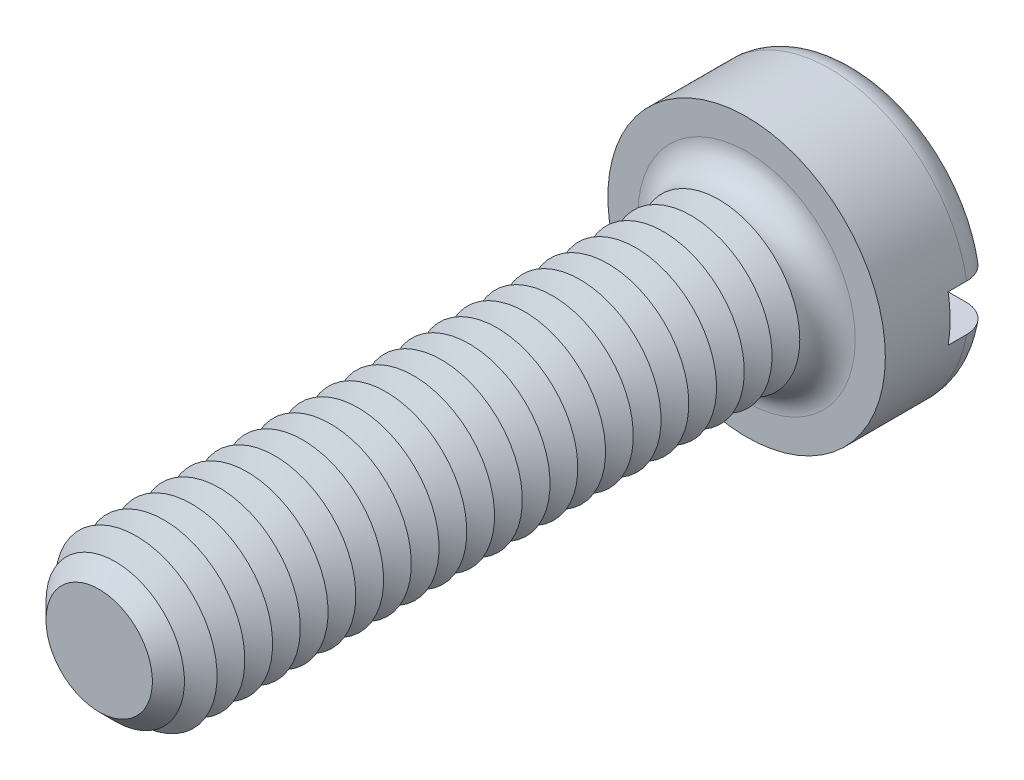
ISO-10303-21;
HEADER;
FILE_DESCRIPTION(('STEP AP214'),'2;1');
FILE_NAME('part.step','',(''),(''),'','','');
FILE_SCHEMA(('AUTOMOTIVE_DESIGN { 1 0 10303 214 1 1 1 1 }'));
ENDSEC;
DATA;
#1=APPLICATION_CONTEXT('core data for automotive mechanical design processes');
#2=APPLICATION_PROTOCOL_DEFINITION('international standard','automotive_design',2000,#1);
#3=PRODUCT_CONTEXT('',#1,'mechanical');
#4=PRODUCT('Part','Part','',(#3));
#5=PRODUCT_RELATED_PRODUCT_CATEGORY('part','',(#4));
#6=PRODUCT_DEFINITION_FORMATION('','',#4);
#7=PRODUCT_DEFINITION_CONTEXT('part definition',#1,'design');
#8=PRODUCT_DEFINITION('design','',#6,#7);
#9=PRODUCT_DEFINITION_SHAPE('','',#8);
#10=(LENGTH_UNIT() NAMED_UNIT(*) SI_UNIT(.MILLI.,.METRE.));
#11=(NAMED_UNIT(*) PLANE_ANGLE_UNIT() SI_UNIT($,.RADIAN.));
#12=(NAMED_UNIT(*) SI_UNIT($,.STERADIAN.) SOLID_ANGLE_UNIT());
#13=UNCERTAINTY_MEASURE_WITH_UNIT(LENGTH_MEASURE(1.E-05),#10,'distance_accuracy_value','');
#14=(GEOMETRIC_REPRESENTATION_CONTEXT(3) GLOBAL_UNCERTAINTY_ASSIGNED_CONTEXT((#13)) GLOBAL_UNIT_ASSIGNED_CONTEXT((#10,
#11,#12)) REPRESENTATION_CONTEXT('',''));
#15=CARTESIAN_POINT('',(0.,0.,0.));
#16=DIRECTION('',(0.,0.,1.));
#17=DIRECTION('',(1.,0.,0.));
#18=AXIS2_PLACEMENT_3D('',#15,#16,#17);
#19=CARTESIAN_POINT('',(0.,0.,-2.4));
#20=DIRECTION('',(0.,0.,1.));
#21=DIRECTION('',(1.,0.,0.));
#22=AXIS2_PLACEMENT_3D('',#19,#20,#21);
#23=PLANE('',#22);
#24=CARTESIAN_POINT('',(0.,0.,-2.4));
#25=DIRECTION('',(0.,0.,1.));
#26=DIRECTION('',(1.,0.,0.));
#27=AXIS2_PLACEMENT_3D('',#24,#25,#26);
#28=CIRCLE('',#27,2.4);
#29=CARTESIAN_POINT('',(-2.3473389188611,0.5,-2.4));
#30=VERTEX_POINT('',#29);
#31=CARTESIAN_POINT('',(2.3473389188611,0.5,-2.4));
#32=VERTEX_POINT('',#31);
#33=EDGE_CURVE('E116',#30,#32,#28,.F.);
#34=ORIENTED_EDGE('',*,*,#33,.T.);
#35=DIRECTION('',(1.,0.,0.));
#36=VECTOR('',#35,1.);
#37=CARTESIAN_POINT('',(-3.,0.5,-2.4));
#38=LINE('',#37,#36);
#39=EDGE_CURVE('E111',#30,#32,#38,.T.);
#40=ORIENTED_EDGE('',*,*,#39,.F.);
#41=EDGE_LOOP('',(#34,#40));
#42=FACE_BOUND('',#41,.T.);
#43=ADVANCED_FACE('F39',(#42),#23,.F.);
#44=CARTESIAN_POINT('',(0.,0.,-1.8));
#45=DIRECTION('',(0.,0.,1.));
#46=DIRECTION('',(1.,0.,0.));
#47=AXIS2_PLACEMENT_3D('',#44,#45,#46);
#48=TOROIDAL_SURFACE('',#47,2.4,0.6);
#49=CARTESIAN_POINT('',(-2.85761641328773,0.5,-2.13010535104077));
#50=CARTESIAN_POINT('',(-2.83871556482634,0.5,-2.1583605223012));
#51=CARTESIAN_POINT('',(-2.81738546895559,0.5,-2.18502342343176));
#52=CARTESIAN_POINT('',(-2.7705148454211,0.5,-2.23439244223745));
#53=CARTESIAN_POINT('',(-2.74496859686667,0.5,-2.25709309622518));
#54=CARTESIAN_POINT('',(-2.6904684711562,0.5,-2.29787524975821));
#55=CARTESIAN_POINT('',(-2.66151863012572,0.5,-2.3159621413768));
#56=CARTESIAN_POINT('',(-2.60103287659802,0.5,-2.34708203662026));
#57=CARTESIAN_POINT('',(-2.56949759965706,0.5,-2.36011627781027));
#58=CARTESIAN_POINT('',(-2.50430694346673,0.5,-2.38095952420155));
#59=CARTESIAN_POINT('',(-2.47062984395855,0.5,-2.38870056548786));
#60=CARTESIAN_POINT('',(-2.40245905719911,0.5,-2.39852415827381));
#61=CARTESIAN_POINT('',(-2.36796525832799,0.5,-2.40060593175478));
#62=CARTESIAN_POINT('',(-2.29850850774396,0.5,-2.39907718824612));
#63=CARTESIAN_POINT('',(-2.2635477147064,0.5,-2.3953679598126));
#64=CARTESIAN_POINT('',(-2.19472542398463,0.5,-2.38219781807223));
#65=CARTESIAN_POINT('',(-2.16086402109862,0.5,-2.37273641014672));
#66=CARTESIAN_POINT('',(-2.09483473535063,0.5,-2.3481926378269));
#67=CARTESIAN_POINT('',(-2.06268841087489,0.5,-2.3330521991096));
#68=CARTESIAN_POINT('',(-2.00140871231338,0.5,-2.29756210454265));
#69=CARTESIAN_POINT('',(-1.97227539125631,0.5,-2.27721235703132));
#70=CARTESIAN_POINT('',(-1.91805676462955,0.5,-2.23196210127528));
#71=CARTESIAN_POINT('',(-1.89294995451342,0.5,-2.20708739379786));
#72=CARTESIAN_POINT('',(-1.84740424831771,0.5,-2.1533758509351));
#73=CARTESIAN_POINT('',(-1.82696468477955,0.5,-2.12453958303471));
#74=CARTESIAN_POINT('',(-1.7919439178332,0.5,-2.06452274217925));
#75=CARTESIAN_POINT('',(-1.7772221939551,0.5,-2.03342424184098));
#76=CARTESIAN_POINT('',(-1.75343025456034,0.5,-1.96913621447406));
#77=CARTESIAN_POINT('',(-1.74435859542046,0.5,-1.93594722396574));
#78=CARTESIAN_POINT('',(-1.73243855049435,0.5,-1.86969199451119));
#79=CARTESIAN_POINT('',(-1.72938008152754,0.5,-1.83666346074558));
#80=CARTESIAN_POINT('',(-1.72896592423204,0.5,-1.77057287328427));
#81=CARTESIAN_POINT('',(-1.73160950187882,0.5,-1.73751082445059));
#82=CARTESIAN_POINT('',(-1.7423966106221,0.5,-1.67291835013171));
#83=CARTESIAN_POINT('',(-1.75043952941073,0.5,-1.64137102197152));
#84=CARTESIAN_POINT('',(-1.77163396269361,0.5,-1.58004446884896));
#85=CARTESIAN_POINT('',(-1.78478577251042,0.5,-1.55026534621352));
#86=CARTESIAN_POINT('',(-1.81598186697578,0.5,-1.49283859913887));
#87=CARTESIAN_POINT('',(-1.83409369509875,0.5,-1.46522772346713));
#88=CARTESIAN_POINT('',(-1.87455179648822,0.5,-1.41330756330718));
#89=CARTESIAN_POINT('',(-1.89689874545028,0.5,-1.38899880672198));
#90=CARTESIAN_POINT('',(-1.94600584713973,0.5,-1.34349499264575));
#91=CARTESIAN_POINT('',(-1.97289034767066,0.5,-1.32243411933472));
#92=CARTESIAN_POINT('',(-2.02972905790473,0.5,-1.28496935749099));
#93=CARTESIAN_POINT('',(-2.05968375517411,0.5,-1.26856621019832));
#94=CARTESIAN_POINT('',(-2.12276894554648,0.5,-1.24040709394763));
#95=CARTESIAN_POINT('',(-2.15596700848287,0.5,-1.22880230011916));
#96=CARTESIAN_POINT('',(-2.22383000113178,0.5,-1.21126311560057));
#97=CARTESIAN_POINT('',(-2.25849504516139,0.5,-1.20532916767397));
#98=CARTESIAN_POINT('',(-2.32870403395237,0.5,-1.1992792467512));
#99=CARTESIAN_POINT('',(-2.36425340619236,0.5,-1.19922586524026));
#100=CARTESIAN_POINT('',(-2.4348506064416,0.5,-1.2051326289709));
#101=CARTESIAN_POINT('',(-2.4698984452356,0.5,-1.21109264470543));
#102=CARTESIAN_POINT('',(-2.53821803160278,0.5,-1.22883658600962));
#103=CARTESIAN_POINT('',(-2.57150081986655,0.5,-1.24057794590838));
#104=CARTESIAN_POINT('',(-2.63557260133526,0.5,-1.2695744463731));
#105=CARTESIAN_POINT('',(-2.66636179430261,0.5,-1.28682914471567));
#106=CARTESIAN_POINT('',(-2.72402406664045,0.5,-1.32606063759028));
#107=CARTESIAN_POINT('',(-2.75095352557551,0.5,-1.34795455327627));
#108=CARTESIAN_POINT('',(-2.80067182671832,0.5,-1.39602603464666));
#109=CARTESIAN_POINT('',(-2.82346106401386,0.5,-1.42220319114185));
#110=CARTESIAN_POINT('',(-2.86383281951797,0.5,-1.47760238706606));
#111=CARTESIAN_POINT('',(-2.88149947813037,0.5,-1.50676312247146));
#112=CARTESIAN_POINT('',(-2.91160874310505,0.5,-1.56766595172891));
#113=CARTESIAN_POINT('',(-2.92405198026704,0.5,-1.59940773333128));
#114=CARTESIAN_POINT('',(-2.94319943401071,0.5,-1.66411282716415));
#115=CARTESIAN_POINT('',(-2.94997843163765,0.5,-1.69705402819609));
#116=CARTESIAN_POINT('',(-2.95787009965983,0.5,-1.7636173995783));
#117=CARTESIAN_POINT('',(-2.95898157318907,0.5,-1.79723971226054));
#118=CARTESIAN_POINT('',(-2.95551354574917,0.5,-1.86397776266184));
#119=CARTESIAN_POINT('',(-2.95096897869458,0.5,-1.89709534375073));
#120=CARTESIAN_POINT('',(-2.93638731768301,0.5,-1.96206785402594));
#121=CARTESIAN_POINT('',(-2.92635713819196,0.5,-1.99392431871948));
#122=CARTESIAN_POINT('',(-2.90618743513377,0.5,-2.04315073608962));
#123=CARTESIAN_POINT('',(-2.89769874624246,0.5,-2.06121519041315));
#124=CARTESIAN_POINT('',(-2.87895753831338,0.5,-2.096404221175));
#125=CARTESIAN_POINT('',(-2.86870503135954,0.5,-2.11352880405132));
#126=CARTESIAN_POINT('',(-2.85761641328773,0.5,-2.13010535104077));
#127=B_SPLINE_CURVE_WITH_KNOTS('',3,(#49,#50,#51,#52,#53,#54,#55,#56,#57,#58,#59,#60,#61,#62,
#63,#64,#65,#66,#67,#68,#69,#70,#71,#72,#73,#74,#75,#76,#77,#78,#79,#80,#81,#82,#83,#84,#85,#86,
#87,#88,#89,#90,#91,#92,#93,#94,#95,#96,#97,#98,#99,#100,#101,#102,#103,#104,#105,#106,#107,
#108,#109,#110,#111,#112,#113,#114,#115,#116,#117,#118,#119,#120,#121,#122,#123,#124,#125,#126),
.UNSPECIFIED.,.T.,.F.,(4,2,2,2,2,2,2,2,2,2,2,2,2,2,2,2,2,2,2,2,2,2,2,2,2,2,2,2,2,2,2,2,2,2,2,2,
2,2,4),(0.,0.101907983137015,0.203955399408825,0.305883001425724,0.407785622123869,
0.510973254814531,0.614175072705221,0.719155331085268,0.824144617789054,0.930238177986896,
1.03633360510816,1.14184204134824,1.24733537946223,1.35004136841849,1.45272110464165,
1.5517448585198,1.65075586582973,1.74797128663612,1.84519232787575,1.9438094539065,
2.0424423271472,2.14443321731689,2.24644032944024,2.35145317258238,2.45647421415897,
2.56261297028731,2.66874944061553,2.77411589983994,2.87947390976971,2.98308820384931,
3.08669260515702,3.18848388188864,3.29026286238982,3.39067588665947,3.49111011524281,
3.59092708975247,3.69061853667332,3.75040561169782,3.81019227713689),.UNSPECIFIED.);
#128=CARTESIAN_POINT('',(-2.95803989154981,0.5,-1.8));
#129=VERTEX_POINT('',#128);
#130=EDGE_CURVE('E361',#129,#30,#127,.T.);
#131=ORIENTED_EDGE('',*,*,#130,.F.);
#132=CARTESIAN_POINT('',(0.,0.,-1.8));
#133=DIRECTION('',(0.,0.,1.));
#134=DIRECTION('',(1.,0.,0.));
#135=AXIS2_PLACEMENT_3D('',#132,#133,#134);
#136=CIRCLE('',#135,3.);
#137=CARTESIAN_POINT('',(2.95803989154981,0.5,-1.8));
#138=VERTEX_POINT('',#137);
#139=EDGE_CURVE('E125',#138,#129,#136,.T.);
#140=ORIENTED_EDGE('',*,*,#139,.F.);
#141=CARTESIAN_POINT('',(1.78664846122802,0.5,-2.05158390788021));
#142=CARTESIAN_POINT('',(1.80142751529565,0.5,-2.08239430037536));
#143=CARTESIAN_POINT('',(1.81889355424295,0.5,-2.111949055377));
#144=CARTESIAN_POINT('',(1.8585933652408,0.5,-2.16770384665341));
#145=CARTESIAN_POINT('',(1.88083491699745,0.5,-2.19389829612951));
#146=CARTESIAN_POINT('',(1.92931942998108,0.5,-2.24217519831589));
#147=CARTESIAN_POINT('',(1.95555471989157,0.5,-2.26426535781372));
#148=CARTESIAN_POINT('',(2.01127789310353,0.5,-2.30384045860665));
#149=CARTESIAN_POINT('',(2.04076488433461,0.5,-2.32132665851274));
#150=CARTESIAN_POINT('',(2.10290022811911,0.5,-2.3516259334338));
#151=CARTESIAN_POINT('',(2.13560600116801,0.5,-2.3643213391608));
#152=CARTESIAN_POINT('',(2.20267136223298,0.5,-2.38412242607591));
#153=CARTESIAN_POINT('',(2.23703118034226,0.5,-2.3912273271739));
#154=CARTESIAN_POINT('',(2.30690186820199,0.5,-2.39969404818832));
#155=CARTESIAN_POINT('',(2.34242185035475,0.5,-2.40098100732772));
#156=CARTESIAN_POINT('',(2.41317063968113,0.5,-2.39753827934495));
#157=CARTESIAN_POINT('',(2.44839945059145,0.5,-2.39280866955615));
#158=CARTESIAN_POINT('',(2.51734146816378,0.5,-2.37746773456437));
#159=CARTESIAN_POINT('',(2.55106223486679,0.5,-2.3668904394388));
#160=CARTESIAN_POINT('',(2.61620389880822,0.5,-2.34013333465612));
#161=CARTESIAN_POINT('',(2.64762498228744,0.5,-2.32395397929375));
#162=CARTESIAN_POINT('',(2.70673284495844,0.5,-2.28672393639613));
#163=CARTESIAN_POINT('',(2.73447138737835,0.5,-2.26575544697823));
#164=CARTESIAN_POINT('',(2.78595339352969,0.5,-2.21938197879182));
#165=CARTESIAN_POINT('',(2.80969724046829,0.5,-2.19397742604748));
#166=CARTESIAN_POINT('',(2.85207235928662,0.5,-2.13993965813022));
#167=CARTESIAN_POINT('',(2.87078674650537,0.5,-2.11137160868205));
#168=CARTESIAN_POINT('',(2.90307455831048,0.5,-2.05146448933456));
#169=CARTESIAN_POINT('',(2.91664841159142,0.5,-2.02012565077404));
#170=CARTESIAN_POINT('',(2.93808283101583,0.5,-1.95603682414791));
#171=CARTESIAN_POINT('',(2.94602016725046,0.5,-1.92331249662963));
#172=CARTESIAN_POINT('',(2.95624273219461,0.5,-1.85699296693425));
#173=CARTESIAN_POINT('',(2.95852824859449,0.5,-1.82339780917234));
#174=CARTESIAN_POINT('',(2.95738171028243,0.5,-1.75655451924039));
#175=CARTESIAN_POINT('',(2.95399174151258,0.5,-1.72330565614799));
#176=CARTESIAN_POINT('',(2.94167749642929,0.5,-1.65784996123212));
#177=CARTESIAN_POINT('',(2.93275329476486,0.5,-1.62564311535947));
#178=CARTESIAN_POINT('',(2.90963870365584,0.5,-1.56317641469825));
#179=CARTESIAN_POINT('',(2.89544787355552,0.5,-1.53291672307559));
#180=CARTESIAN_POINT('',(2.86222325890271,0.5,-1.47518589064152));
#181=CARTESIAN_POINT('',(2.84318935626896,0.5,-1.44771481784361));
#182=CARTESIAN_POINT('',(2.80067851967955,0.5,-1.39611362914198));
#183=CARTESIAN_POINT('',(2.77716960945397,0.5,-1.37200986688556));
#184=CARTESIAN_POINT('',(2.72648704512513,0.5,-1.3280274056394));
#185=CARTESIAN_POINT('',(2.69931317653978,0.5,-1.3081489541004));
#186=CARTESIAN_POINT('',(2.64167967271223,0.5,-1.27288334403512));
#187=CARTESIAN_POINT('',(2.61118015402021,0.5,-1.25756138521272));
#188=CARTESIAN_POINT('',(2.54807315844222,0.5,-1.2321564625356));
#189=CARTESIAN_POINT('',(2.51546550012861,0.5,-1.22207395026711));
#190=CARTESIAN_POINT('',(2.44846246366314,0.5,-1.20724783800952));
#191=CARTESIAN_POINT('',(2.41404584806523,0.5,-1.2026002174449));
#192=CARTESIAN_POINT('',(2.34491756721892,0.5,-1.19904907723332));
#193=CARTESIAN_POINT('',(2.3102058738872,0.5,-1.20014611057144));
#194=CARTESIAN_POINT('',(2.24087507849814,0.5,-1.20808958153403));
#195=CARTESIAN_POINT('',(2.20626660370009,0.5,-1.21502895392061));
#196=CARTESIAN_POINT('',(2.13868705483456,0.5,-1.23457616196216));
#197=CARTESIAN_POINT('',(2.10571611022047,0.5,-1.24718444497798));
#198=CARTESIAN_POINT('',(2.04212010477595,0.5,-1.2778419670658));
#199=CARTESIAN_POINT('',(2.0115131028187,0.5,-1.29592871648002));
#200=CARTESIAN_POINT('',(1.95381117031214,0.5,-1.33703838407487));
#201=CARTESIAN_POINT('',(1.92671618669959,0.5,-1.36006122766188));
#202=CARTESIAN_POINT('',(1.8771749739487,0.5,-1.41014760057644));
#203=CARTESIAN_POINT('',(1.85467966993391,0.5,-1.43716252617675));
#204=CARTESIAN_POINT('',(1.8147167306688,0.5,-1.49468601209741));
#205=CARTESIAN_POINT('',(1.79724791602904,0.5,-1.52519375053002));
#206=CARTESIAN_POINT('',(1.76843420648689,0.5,-1.58782676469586));
#207=CARTESIAN_POINT('',(1.75691546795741,0.5,-1.61987202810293));
#208=CARTESIAN_POINT('',(1.73963101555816,0.5,-1.68548715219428));
#209=CARTESIAN_POINT('',(1.73386545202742,0.5,-1.71905705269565));
#210=CARTESIAN_POINT('',(1.72840927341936,0.5,-1.78556262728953));
#211=CARTESIAN_POINT('',(1.72852416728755,0.5,-1.8184825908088));
#212=CARTESIAN_POINT('',(1.73434422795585,0.5,-1.88379362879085));
#213=CARTESIAN_POINT('',(1.74004181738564,0.5,-1.91618535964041));
#214=CARTESIAN_POINT('',(1.75312909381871,0.5,-1.96568884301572));
#215=CARTESIAN_POINT('',(1.75869685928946,0.5,-1.98330302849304));
#216=CARTESIAN_POINT('',(1.77146455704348,0.5,-2.01792824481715));
#217=CARTESIAN_POINT('',(1.7786644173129,0.5,-2.03493930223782));
#218=CARTESIAN_POINT('',(1.78664846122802,0.5,-2.05158390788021));
#219=B_SPLINE_CURVE_WITH_KNOTS('',3,(#141,#142,#143,#144,#145,#146,#147,#148,#149,#150,#151,
#152,#153,#154,#155,#156,#157,#158,#159,#160,#161,#162,#163,#164,#165,#166,#167,#168,#169,#170,
#171,#172,#173,#174,#175,#176,#177,#178,#179,#180,#181,#182,#183,#184,#185,#186,#187,#188,#189,
#190,#191,#192,#193,#194,#195,#196,#197,#198,#199,#200,#201,#202,#203,#204,#205,#206,#207,#208,
#209,#210,#211,#212,#213,#214,#215,#216,#217,#218),.UNSPECIFIED.,.T.,.F.,(4,2,2,2,2,2,2,2,2,2,2,
2,2,2,2,2,2,2,2,2,2,2,2,2,2,2,2,2,2,2,2,2,2,2,2,2,2,2,4),(0.,0.10244464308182,0.205057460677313,
0.307475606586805,0.409865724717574,0.514628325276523,0.619405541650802,0.72552718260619,
0.831647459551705,0.937156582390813,1.04265715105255,1.1464674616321,1.25026780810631,
1.3522293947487,1.45418247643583,1.55471883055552,1.6552500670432,1.75503912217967,
1.8548268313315,1.95462289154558,2.05442138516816,2.15496174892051,2.25550799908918,
2.35743049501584,2.45936177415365,2.56306719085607,2.66678259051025,2.77217967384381,
2.87758507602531,2.98372914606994,3.08987161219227,3.19481457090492,3.29973288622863,
3.40138228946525,3.50303434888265,3.60132659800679,3.69948562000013,3.75483142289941,
3.8101747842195),.UNSPECIFIED.);
#220=EDGE_CURVE('E363',#32,#138,#219,.T.);
#221=ORIENTED_EDGE('',*,*,#220,.F.);
#222=ORIENTED_EDGE('',*,*,#33,.F.);
#223=EDGE_LOOP('',(#131,#140,#221,#222));
#224=FACE_BOUND('',#223,.T.);
#225=ADVANCED_FACE('F345',(#224),#48,.T.);
#226=CARTESIAN_POINT('',(0.,0.,-2.4));
#227=DIRECTION('',(0.,0.,1.));
#228=DIRECTION('',(1.,0.,0.));
#229=AXIS2_PLACEMENT_3D('',#226,#227,#228);
#230=CYLINDRICAL_SURFACE('',#229,3.);
#231=DIRECTION('',(0.,0.,1.));
#232=VECTOR('',#231,1.);
#233=CARTESIAN_POINT('',(2.95803989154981,0.5,-2.4));
#234=LINE('',#233,#232);
#235=CARTESIAN_POINT('',(2.95803989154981,0.5,-1.4));
#236=VERTEX_POINT('',#235);
#237=EDGE_CURVE('E379',#138,#236,#234,.T.);
#238=ORIENTED_EDGE('',*,*,#237,.F.);
#239=ORIENTED_EDGE('',*,*,#139,.T.);
#240=DIRECTION('',(0.,0.,1.));
#241=VECTOR('',#240,1.);
#242=CARTESIAN_POINT('',(-2.95803989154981,0.5,-2.4));
#243=LINE('',#242,#241);
#244=CARTESIAN_POINT('',(-2.95803989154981,0.5,-1.4));
#245=VERTEX_POINT('',#244);
#246=EDGE_CURVE('E63',#245,#129,#243,.F.);
#247=ORIENTED_EDGE('',*,*,#246,.F.);
#248=CARTESIAN_POINT('',(0.,0.,-1.4));
#249=DIRECTION('',(0.,0.,-1.));
#250=DIRECTION('',(-1.,0.,0.));
#251=AXIS2_PLACEMENT_3D('',#248,#249,#250);
#252=CIRCLE('',#251,3.);
#253=CARTESIAN_POINT('',(-2.95803989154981,-0.5,-1.4));
#254=VERTEX_POINT('',#253);
#255=EDGE_CURVE('E43',#245,#254,#252,.F.);
#256=ORIENTED_EDGE('',*,*,#255,.T.);
#257=DIRECTION('',(0.,0.,1.));
#258=VECTOR('',#257,1.);
#259=CARTESIAN_POINT('',(-2.95803989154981,-0.5,-2.4));
#260=LINE('',#259,#258);
#261=CARTESIAN_POINT('',(-2.9580398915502,-0.5,-1.79999999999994));
#262=VERTEX_POINT('',#261);
#263=EDGE_CURVE('E376',#262,#254,#260,.T.);
#264=ORIENTED_EDGE('',*,*,#263,.F.);
#265=CARTESIAN_POINT('',(2.95803989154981,-0.5,-1.8));
#266=VERTEX_POINT('',#265);
#267=EDGE_CURVE('E127',#262,#266,#136,.T.);
#268=ORIENTED_EDGE('',*,*,#267,.T.);
#269=DIRECTION('',(0.,0.,1.));
#270=VECTOR('',#269,1.);
#271=CARTESIAN_POINT('',(2.95803989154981,-0.5,-2.4));
#272=LINE('',#271,#270);
#273=CARTESIAN_POINT('',(2.95803989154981,-0.5,-1.4));
#274=VERTEX_POINT('',#273);
#275=EDGE_CURVE('E55',#274,#266,#272,.F.);
#276=ORIENTED_EDGE('',*,*,#275,.F.);
#277=EDGE_CURVE('E11',#274,#236,#252,.F.);
#278=ORIENTED_EDGE('',*,*,#277,.T.);
#279=EDGE_LOOP('',(#238,#239,#247,#256,#264,#268,#276,#278));
#280=FACE_BOUND('',#279,.T.);
#281=CARTESIAN_POINT('',(0.,0.,0.));
#282=DIRECTION('',(0.,0.,1.));
#283=DIRECTION('',(1.,0.,0.));
#284=AXIS2_PLACEMENT_3D('',#281,#282,#283);
#285=CIRCLE('',#284,3.);
#286=CARTESIAN_POINT('',(3.,0.,0.));
#287=VERTEX_POINT('',#286);
#288=EDGE_CURVE('E382',#287,#287,#285,.T.);
#289=ORIENTED_EDGE('',*,*,#288,.F.);
#290=EDGE_LOOP('',(#289));
#291=FACE_BOUND('',#290,.T.);
#292=ADVANCED_FACE('F341',(#280,#291),#230,.T.);
#293=CARTESIAN_POINT('',(2.3473389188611,-0.5,-2.4));
#294=VERTEX_POINT('',#293);
#295=CARTESIAN_POINT('',(-2.3473389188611,-0.5,-2.4));
#296=VERTEX_POINT('',#295);
#297=EDGE_CURVE('E109',#294,#296,#28,.F.);
#298=ORIENTED_EDGE('',*,*,#297,.T.);
#299=DIRECTION('',(-1.,0.,0.));
#300=VECTOR('',#299,1.);
#301=CARTESIAN_POINT('',(-3.,-0.5,-2.4));
#302=LINE('',#301,#300);
#303=EDGE_CURVE('E96',#294,#296,#302,.T.);
#304=ORIENTED_EDGE('',*,*,#303,.F.);
#305=EDGE_LOOP('',(#298,#304));
#306=FACE_BOUND('',#305,.T.);
#307=ADVANCED_FACE('F108',(#306),#23,.F.);
#308=CARTESIAN_POINT('',(0.,0.,0.));
#309=DIRECTION('',(0.,0.,1.));
#310=DIRECTION('',(1.,0.,0.));
#311=AXIS2_PLACEMENT_3D('',#308,#309,#310);
#312=PLANE('',#311);
#313=CARTESIAN_POINT('',(0.,0.,0.));
#314=DIRECTION('',(0.,0.,1.));
#315=DIRECTION('',(1.,0.,0.));
#316=AXIS2_PLACEMENT_3D('',#313,#314,#315);
#317=CIRCLE('',#316,2.35);
#318=CARTESIAN_POINT('',(2.35,0.,0.));
#319=VERTEX_POINT('',#318);
#320=EDGE_CURVE('E115',#319,#319,#317,.F.);
#321=ORIENTED_EDGE('',*,*,#320,.T.);
#322=EDGE_LOOP('',(#321));
#323=FACE_BOUND('',#322,.T.);
#324=ORIENTED_EDGE('',*,*,#288,.T.);
#325=EDGE_LOOP('',(#324));
#326=FACE_BOUND('',#325,.T.);
#327=ADVANCED_FACE('F340',(#323,#326),#312,.T.);
#328=CARTESIAN_POINT('',(-2.85761641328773,-0.5,-2.13010535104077));
#329=CARTESIAN_POINT('',(-2.87617085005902,-0.5,-2.10236255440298));
#330=CARTESIAN_POINT('',(-2.89241094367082,-0.5,-2.07304478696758));
#331=CARTESIAN_POINT('',(-2.91975805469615,-0.5,-2.01207835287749));
#332=CARTESIAN_POINT('',(-2.93085958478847,-0.5,-1.98042723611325));
#333=CARTESIAN_POINT('',(-2.94757590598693,-0.5,-1.91570997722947));
#334=CARTESIAN_POINT('',(-2.95319165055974,-0.5,-1.88264408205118));
#335=CARTESIAN_POINT('',(-2.95876526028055,-0.5,-1.81604673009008));
#336=CARTESIAN_POINT('',(-2.95872441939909,-0.5,-1.78251538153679));
#337=CARTESIAN_POINT('',(-2.95300126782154,-0.5,-1.71606888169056));
#338=CARTESIAN_POINT('',(-2.94734076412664,-0.5,-1.68315184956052));
#339=CARTESIAN_POINT('',(-2.93058183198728,-0.5,-1.61873244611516));
#340=CARTESIAN_POINT('',(-2.91948325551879,-0.5,-1.58723011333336));
#341=CARTESIAN_POINT('',(-2.89215903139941,-0.5,-1.52647404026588));
#342=CARTESIAN_POINT('',(-2.87592518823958,-0.5,-1.49722398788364));
#343=CARTESIAN_POINT('',(-2.83881787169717,-0.5,-1.44183365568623));
#344=CARTESIAN_POINT('',(-2.81794425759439,-0.5,-1.41569347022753));
#345=CARTESIAN_POINT('',(-2.77196258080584,-0.5,-1.36700890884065));
#346=CARTESIAN_POINT('',(-2.74681874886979,-0.5,-1.34449832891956));
#347=CARTESIAN_POINT('',(-2.69315595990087,-0.5,-1.30394571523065));
#348=CARTESIAN_POINT('',(-2.66463678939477,-0.5,-1.28590396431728));
#349=CARTESIAN_POINT('',(-2.6045885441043,-0.5,-1.25451133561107));
#350=CARTESIAN_POINT('',(-2.573021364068,-0.5,-1.24123336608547));
#351=CARTESIAN_POINT('',(-2.50813094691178,-0.5,-1.22006271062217));
#352=CARTESIAN_POINT('',(-2.47480755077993,-0.5,-1.21217051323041));
#353=CARTESIAN_POINT('',(-2.40672281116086,-0.5,-1.20185046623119));
#354=CARTESIAN_POINT('',(-2.37194646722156,-0.5,-1.19952155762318));
#355=CARTESIAN_POINT('',(-2.30248663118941,-0.5,-1.20064178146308));
#356=CARTESIAN_POINT('',(-2.26780314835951,-0.5,-1.20409147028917));
#357=CARTESIAN_POINT('',(-2.19896003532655,-0.5,-1.21674803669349));
#358=CARTESIAN_POINT('',(-2.16481620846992,-0.5,-1.22604100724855));
#359=CARTESIAN_POINT('',(-2.09855902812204,-0.5,-1.25020237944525));
#360=CARTESIAN_POINT('',(-2.0664458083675,-0.5,-1.2650711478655));
#361=CARTESIAN_POINT('',(-2.00504979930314,-0.5,-1.3000633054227));
#362=CARTESIAN_POINT('',(-1.97577870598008,-0.5,-1.32020724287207));
#363=CARTESIAN_POINT('',(-1.92109882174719,-0.5,-1.36519538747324));
#364=CARTESIAN_POINT('',(-1.89568984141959,-0.5,-1.39003936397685));
#365=CARTESIAN_POINT('',(-1.84992350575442,-0.5,-1.44333696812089));
#366=CARTESIAN_POINT('',(-1.82949305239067,-0.5,-1.47172774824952));
#367=CARTESIAN_POINT('',(-1.79388305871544,-0.5,-1.53163225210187));
#368=CARTESIAN_POINT('',(-1.77870235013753,-0.5,-1.56314527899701));
#369=CARTESIAN_POINT('',(-1.7545759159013,-0.5,-1.62726698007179));
#370=CARTESIAN_POINT('',(-1.74543784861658,-0.5,-1.65980327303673));
#371=CARTESIAN_POINT('',(-1.73294830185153,-0.5,-1.72596654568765));
#372=CARTESIAN_POINT('',(-1.72959555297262,-0.5,-1.7595932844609));
#373=CARTESIAN_POINT('',(-1.72881879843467,-0.5,-1.82588200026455));
#374=CARTESIAN_POINT('',(-1.73121660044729,-0.5,-1.85854202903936));
#375=CARTESIAN_POINT('',(-1.74148022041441,-0.5,-1.9229888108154));
#376=CARTESIAN_POINT('',(-1.74934586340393,-0.5,-1.95477559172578));
#377=CARTESIAN_POINT('',(-1.77023164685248,-0.5,-2.01650910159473));
#378=CARTESIAN_POINT('',(-1.78323812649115,-0.5,-2.04646046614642));
#379=CARTESIAN_POINT('',(-1.81396733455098,-0.5,-2.10383471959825));
#380=CARTESIAN_POINT('',(-1.83169061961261,-0.5,-2.13125730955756));
#381=CARTESIAN_POINT('',(-1.87183626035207,-0.5,-2.18359240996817));
#382=CARTESIAN_POINT('',(-1.89437158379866,-0.5,-2.20841820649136));
#383=CARTESIAN_POINT('',(-1.9431646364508,-0.5,-2.25409214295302));
#384=CARTESIAN_POINT('',(-1.96942301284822,-0.5,-2.27493958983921));
#385=CARTESIAN_POINT('',(-2.025898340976,-0.5,-2.31281042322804));
#386=CARTESIAN_POINT('',(-2.05622082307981,-0.5,-2.32967654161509));
#387=CARTESIAN_POINT('',(-2.11922391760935,-0.5,-2.35820255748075));
#388=CARTESIAN_POINT('',(-2.15190483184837,-0.5,-2.3698617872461));
#389=CARTESIAN_POINT('',(-2.21944675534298,-0.5,-2.38785911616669));
#390=CARTESIAN_POINT('',(-2.25433929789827,-0.5,-2.39407914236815));
#391=CARTESIAN_POINT('',(-2.32467357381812,-0.5,-2.40058243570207));
#392=CARTESIAN_POINT('',(-2.36011530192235,-0.5,-2.40086575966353));
#393=CARTESIAN_POINT('',(-2.43058129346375,-0.5,-2.39545061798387));
#394=CARTESIAN_POINT('',(-2.46560504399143,-0.5,-2.38974544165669));
#395=CARTESIAN_POINT('',(-2.53418188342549,-0.5,-2.37245602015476));
#396=CARTESIAN_POINT('',(-2.56773468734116,-0.5,-2.36087064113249));
#397=CARTESIAN_POINT('',(-2.63195003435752,-0.5,-2.33229154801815));
#398=CARTESIAN_POINT('',(-2.66264330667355,-0.5,-2.31536681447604));
#399=CARTESIAN_POINT('',(-2.72065333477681,-0.5,-2.2765252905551));
#400=CARTESIAN_POINT('',(-2.7479744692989,-0.5,-2.25461508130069));
#401=CARTESIAN_POINT('',(-2.78903570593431,-0.5,-2.21539504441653));
#402=CARTESIAN_POINT('',(-2.80405150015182,-0.5,-2.19939833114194));
#403=CARTESIAN_POINT('',(-2.83224965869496,-0.5,-2.16586257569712));
#404=CARTESIAN_POINT('',(-2.84543204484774,-0.5,-2.14832355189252));
#405=CARTESIAN_POINT('',(-2.85761641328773,-0.5,-2.13010535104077));
#406=B_SPLINE_CURVE_WITH_KNOTS('',3,(#328,#329,#330,#331,#332,#333,#334,#335,#336,#337,#338,
#339,#340,#341,#342,#343,#344,#345,#346,#347,#348,#349,#350,#351,#352,#353,#354,#355,#356,#357,
#358,#359,#360,#361,#362,#363,#364,#365,#366,#367,#368,#369,#370,#371,#372,#373,#374,#375,#376,
#377,#378,#379,#380,#381,#382,#383,#384,#385,#386,#387,#388,#389,#390,#391,#392,#393,#394,#395,
#396,#397,#398,#399,#400,#401,#402,#403,#404,#405),.UNSPECIFIED.,.T.,.F.,(4,2,2,2,2,2,2,2,2,2,2,
2,2,2,2,2,2,2,2,2,2,2,2,2,2,2,2,2,2,2,2,2,2,2,2,2,2,2,4),(0.,0.100047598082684,
0.200201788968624,0.300338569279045,0.400452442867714,0.500179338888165,0.599908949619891,
0.699798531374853,0.799691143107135,0.900465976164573,1.00124718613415,1.10351091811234,
1.20578392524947,1.30986270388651,1.41395150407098,1.51961105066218,1.62527754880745,
1.73136193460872,1.83744111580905,1.94185359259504,2.04624281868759,2.1471248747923,
2.24798479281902,2.34575994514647,2.44353196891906,2.541045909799,2.63857136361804,
2.73870431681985,2.83885469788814,2.94247024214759,3.0460990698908,3.15192527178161,
3.25775046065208,3.36369436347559,3.46965870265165,3.57430655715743,3.67881706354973,
3.74451732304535,3.81021680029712),.UNSPECIFIED.);
#407=EDGE_CURVE('E103',#296,#262,#406,.T.);
#408=ORIENTED_EDGE('',*,*,#407,.F.);
#409=ORIENTED_EDGE('',*,*,#297,.F.);
#410=CARTESIAN_POINT('',(1.78664846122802,-0.5,-2.05158390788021));
#411=CARTESIAN_POINT('',(1.77253256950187,-0.5,-2.02214917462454));
#412=CARTESIAN_POINT('',(1.76084795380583,-0.5,-1.99152692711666));
#413=CARTESIAN_POINT('',(1.74276267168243,-0.5,-1.92873811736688));
#414=CARTESIAN_POINT('',(1.73636622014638,-0.5,-1.89657034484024));
#415=CARTESIAN_POINT('',(1.72910271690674,-0.5,-1.83160458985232));
#416=CARTESIAN_POINT('',(1.72823699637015,-0.5,-1.79880645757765));
#417=CARTESIAN_POINT('',(1.73207277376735,-0.5,-1.73354460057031));
#418=CARTESIAN_POINT('',(1.7367732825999,-0.5,-1.70108081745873));
#419=CARTESIAN_POINT('',(1.75151033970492,-0.5,-1.63763571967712));
#420=CARTESIAN_POINT('',(1.76150868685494,-0.5,-1.60664550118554));
#421=CARTESIAN_POINT('',(1.78646773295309,-0.5,-1.54673433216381));
#422=CARTESIAN_POINT('',(1.80142897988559,-0.5,-1.51781361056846));
#423=CARTESIAN_POINT('',(1.8361687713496,-0.5,-1.46223275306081));
#424=CARTESIAN_POINT('',(1.85603637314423,-0.5,-1.43562834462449));
#425=CARTESIAN_POINT('',(1.89981598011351,-0.5,-1.38598822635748));
#426=CARTESIAN_POINT('',(1.92372865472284,-0.5,-1.3629531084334));
#427=CARTESIAN_POINT('',(1.97581791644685,-0.5,-1.32025912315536));
#428=CARTESIAN_POINT('',(2.00411431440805,-0.5,-1.30074638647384));
#429=CARTESIAN_POINT('',(2.06351340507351,-0.5,-1.26660223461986));
#430=CARTESIAN_POINT('',(2.09461651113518,-0.5,-1.2519715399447));
#431=CARTESIAN_POINT('',(2.15964055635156,-0.5,-1.22763649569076));
#432=CARTESIAN_POINT('',(2.19361437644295,-0.5,-1.21807321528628));
#433=CARTESIAN_POINT('',(2.26268197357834,-0.5,-1.20474094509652));
#434=CARTESIAN_POINT('',(2.29777581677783,-0.5,-1.20097229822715));
#435=CARTESIAN_POINT('',(2.36834397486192,-0.5,-1.19935270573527));
#436=CARTESIAN_POINT('',(2.40381924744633,-0.5,-1.20154258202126));
#437=CARTESIAN_POINT('',(2.47388621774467,-0.5,-1.211906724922));
#438=CARTESIAN_POINT('',(2.50847794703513,-0.5,-1.22008077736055));
#439=CARTESIAN_POINT('',(2.57542869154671,-0.5,-1.24211740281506));
#440=CARTESIAN_POINT('',(2.60780612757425,-0.5,-1.25592395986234));
#441=CARTESIAN_POINT('',(2.66972487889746,-0.5,-1.28886991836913));
#442=CARTESIAN_POINT('',(2.69926644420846,-0.5,-1.3080088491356));
#443=CARTESIAN_POINT('',(2.75412764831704,-0.5,-1.35072337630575));
#444=CARTESIAN_POINT('',(2.77951140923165,-0.5,-1.37421661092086));
#445=CARTESIAN_POINT('',(2.82588981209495,-0.5,-1.42519687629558));
#446=CARTESIAN_POINT('',(2.84688487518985,-0.5,-1.4526835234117));
#447=CARTESIAN_POINT('',(2.88351678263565,-0.5,-1.51036368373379));
#448=CARTESIAN_POINT('',(2.89923879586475,-0.5,-1.54050312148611));
#449=CARTESIAN_POINT('',(2.92532780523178,-0.5,-1.60301687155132));
#450=CARTESIAN_POINT('',(2.93569520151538,-0.5,-1.63539101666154));
#451=CARTESIAN_POINT('',(2.95066155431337,-0.5,-1.70102985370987));
#452=CARTESIAN_POINT('',(2.95532930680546,-0.5,-1.73427887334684));
#453=CARTESIAN_POINT('',(2.9589838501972,-0.5,-1.80108716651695));
#454=CARTESIAN_POINT('',(2.95797087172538,-0.5,-1.83464642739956));
#455=CARTESIAN_POINT('',(2.9503157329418,-0.5,-1.90093629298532));
#456=CARTESIAN_POINT('',(2.9437032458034,-0.5,-1.93367033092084));
#457=CARTESIAN_POINT('',(2.92508830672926,-0.5,-1.99756717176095));
#458=CARTESIAN_POINT('',(2.91308586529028,-0.5,-2.02872997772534));
#459=CARTESIAN_POINT('',(2.88401713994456,-0.5,-2.08868263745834));
#460=CARTESIAN_POINT('',(2.86693946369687,-0.5,-2.11746696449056));
#461=CARTESIAN_POINT('',(2.82823635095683,-0.5,-2.17179415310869));
#462=CARTESIAN_POINT('',(2.80661076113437,-0.5,-2.19733690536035));
#463=CARTESIAN_POINT('',(2.75921750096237,-0.5,-2.24472182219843));
#464=CARTESIAN_POINT('',(2.73341278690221,-0.5,-2.26652692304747));
#465=CARTESIAN_POINT('',(2.67855512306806,-0.5,-2.30557116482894));
#466=CARTESIAN_POINT('',(2.64950194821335,-0.5,-2.32280998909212));
#467=CARTESIAN_POINT('',(2.58850670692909,-0.5,-2.35251615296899));
#468=CARTESIAN_POINT('',(2.55652763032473,-0.5,-2.36490748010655));
#469=CARTESIAN_POINT('',(2.4909651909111,-0.5,-2.38424946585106));
#470=CARTESIAN_POINT('',(2.45738167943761,-0.5,-2.39119961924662));
#471=CARTESIAN_POINT('',(2.38892891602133,-0.5,-2.39958830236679));
#472=CARTESIAN_POINT('',(2.35404742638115,-0.5,-2.40092701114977));
#473=CARTESIAN_POINT('',(2.28454389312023,-0.5,-2.39781917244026));
#474=CARTESIAN_POINT('',(2.24992186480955,-0.5,-2.39337228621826));
#475=CARTESIAN_POINT('',(2.18139250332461,-0.5,-2.37872879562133));
#476=CARTESIAN_POINT('',(2.14750264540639,-0.5,-2.36845030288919));
#477=CARTESIAN_POINT('',(2.08190943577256,-0.5,-2.34236291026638));
#478=CARTESIAN_POINT('',(2.05020675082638,-0.5,-2.32655233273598));
#479=CARTESIAN_POINT('',(1.98982495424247,-0.5,-2.28976285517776));
#480=CARTESIAN_POINT('',(1.96115527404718,-0.5,-2.26876847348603));
#481=CARTESIAN_POINT('',(1.90785147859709,-0.5,-2.22220002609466));
#482=CARTESIAN_POINT('',(1.88321231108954,-0.5,-2.19663177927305));
#483=CARTESIAN_POINT('',(1.84638483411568,-0.5,-2.15106161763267));
#484=CARTESIAN_POINT('',(1.8328227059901,-0.5,-2.13215328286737));
#485=CARTESIAN_POINT('',(1.80797918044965,-0.5,-2.09289185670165));
#486=CARTESIAN_POINT('',(1.79669771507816,-0.5,-2.07253880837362));
#487=CARTESIAN_POINT('',(1.78664846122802,-0.5,-2.05158390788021));
#488=B_SPLINE_CURVE_WITH_KNOTS('',3,(#410,#411,#412,#413,#414,#415,#416,#417,#418,#419,#420,
#421,#422,#423,#424,#425,#426,#427,#428,#429,#430,#431,#432,#433,#434,#435,#436,#437,#438,#439,
#440,#441,#442,#443,#444,#445,#446,#447,#448,#449,#450,#451,#452,#453,#454,#455,#456,#457,#458,
#459,#460,#461,#462,#463,#464,#465,#466,#467,#468,#469,#470,#471,#472,#473,#474,#475,#476,#477,
#478,#479,#480,#481,#482,#483,#484,#485,#486,#487),.UNSPECIFIED.,.T.,.F.,(4,2,2,2,2,2,2,2,2,2,2,
2,2,2,2,2,2,2,2,2,2,2,2,2,2,2,2,2,2,2,2,2,2,2,2,2,2,2,4),(0.,0.0978512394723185,0.19578039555,
0.293733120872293,0.391668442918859,0.488907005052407,0.58615630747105,0.685320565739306,
0.784501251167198,0.887148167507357,0.989810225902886,1.09519726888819,1.20059054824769,
1.30670769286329,1.41282103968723,1.51790384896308,1.62297738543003,1.72623563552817,
1.82948397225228,1.93097382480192,2.03245609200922,2.13270093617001,2.23294171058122,
2.33265458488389,2.43236726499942,2.53230548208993,2.63224706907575,2.73312861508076,
2.83401715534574,2.93642973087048,3.03885181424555,3.14308833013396,3.24733094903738,
3.35307493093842,3.45885100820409,3.56494689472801,3.67090875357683,3.74057217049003,
3.81023351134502),.UNSPECIFIED.);
#489=EDGE_CURVE('E92',#266,#294,#488,.T.);
#490=ORIENTED_EDGE('',*,*,#489,.F.);
#491=ORIENTED_EDGE('',*,*,#267,.F.);
#492=EDGE_LOOP('',(#408,#409,#490,#491));
#493=FACE_BOUND('',#492,.T.);
#494=ADVANCED_FACE('F113',(#493),#48,.T.);
#495=CARTESIAN_POINT('',(0.,0.,0.6));
#496=DIRECTION('',(0.,0.,1.));
#497=DIRECTION('',(1.,0.,0.));
#498=AXIS2_PLACEMENT_3D('',#495,#496,#497);
#499=TOROIDAL_SURFACE('',#498,2.35,0.6);
#500=ORIENTED_EDGE('',*,*,#320,.F.);
#501=EDGE_LOOP('',(#500));
#502=FACE_BOUND('',#501,.T.);
#503=CARTESIAN_POINT('',(0.,0.,0.6));
#504=DIRECTION('',(0.,0.,-1.));
#505=DIRECTION('',(-1.,0.,0.));
#506=AXIS2_PLACEMENT_3D('',#503,#504,#505);
#507=CIRCLE('',#506,1.75);
#508=CARTESIAN_POINT('',(-1.75,0.,0.6));
#509=VERTEX_POINT('',#508);
#510=EDGE_CURVE('E387',#509,#509,#507,.T.);
#511=ORIENTED_EDGE('',*,*,#510,.T.);
#512=EDGE_LOOP('',(#511));
#513=FACE_BOUND('',#512,.T.);
#514=ADVANCED_FACE('F333',(#502,#513),#499,.F.);
#515=CARTESIAN_POINT('',(0.,0.,0.9));
#516=DIRECTION('',(0.,0.,-1.));
#517=DIRECTION('',(-1.,0.,0.));
#518=AXIS2_PLACEMENT_3D('',#515,#516,#517);
#519=CONICAL_SURFACE('',#518,1.23038475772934,1.0471975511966);
#520=ORIENTED_EDGE('',*,*,#510,.F.);
#521=EDGE_LOOP('',(#520));
#522=FACE_BOUND('',#521,.T.);
#523=CARTESIAN_POINT('',(0.,0.,0.9));
#524=DIRECTION('',(0.,0.,-1.));
#525=DIRECTION('',(-1.,0.,0.));
#526=AXIS2_PLACEMENT_3D('',#523,#524,#525);
#527=CIRCLE('',#526,1.23038475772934);
#528=CARTESIAN_POINT('',(-1.23038475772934,0.,0.9));
#529=VERTEX_POINT('',#528);
#530=EDGE_CURVE('E393',#529,#529,#527,.T.);
#531=ORIENTED_EDGE('',*,*,#530,.T.);
#532=EDGE_LOOP('',(#531));
#533=FACE_BOUND('',#532,.T.);
#534=ADVANCED_FACE('F329',(#522,#533),#519,.T.);
#535=CARTESIAN_POINT('',(0.,0.,1.2));
#536=DIRECTION('',(0.,0.,1.));
#537=DIRECTION('',(1.,0.,0.));
#538=AXIS2_PLACEMENT_3D('',#535,#536,#537);
#539=CONICAL_SURFACE('',#538,1.75,1.0471975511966);
#540=ORIENTED_EDGE('',*,*,#530,.F.);
#541=EDGE_LOOP('',(#540));
#542=FACE_BOUND('',#541,.T.);
#543=CARTESIAN_POINT('',(0.,0.,1.2));
#544=DIRECTION('',(0.,0.,-1.));
#545=DIRECTION('',(-1.,0.,0.));
#546=AXIS2_PLACEMENT_3D('',#543,#544,#545);
#547=CIRCLE('',#546,1.75);
#548=CARTESIAN_POINT('',(-1.75,0.,1.2));
#549=VERTEX_POINT('',#548);
#550=EDGE_CURVE('E399',#549,#549,#547,.T.);
#551=ORIENTED_EDGE('',*,*,#550,.T.);
#552=EDGE_LOOP('',(#551));
#553=FACE_BOUND('',#552,.T.);
#554=ADVANCED_FACE('F325',(#542,#553),#539,.T.);
#555=CARTESIAN_POINT('',(0.,0.,1.5));
#556=DIRECTION('',(0.,0.,-1.));
#557=DIRECTION('',(-1.,0.,0.));
#558=AXIS2_PLACEMENT_3D('',#555,#556,#557);
#559=CONICAL_SURFACE('',#558,1.23038475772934,1.0471975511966);
#560=ORIENTED_EDGE('',*,*,#550,.F.);
#561=EDGE_LOOP('',(#560));
#562=FACE_BOUND('',#561,.T.);
#563=CARTESIAN_POINT('',(0.,0.,1.5));
#564=DIRECTION('',(0.,0.,-1.));
#565=DIRECTION('',(-1.,0.,0.));
#566=AXIS2_PLACEMENT_3D('',#563,#564,#565);
#567=CIRCLE('',#566,1.23038475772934);
#568=CARTESIAN_POINT('',(-1.23038475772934,0.,1.5));
#569=VERTEX_POINT('',#568);
#570=EDGE_CURVE('E403',#569,#569,#567,.T.);
#571=ORIENTED_EDGE('',*,*,#570,.T.);
#572=EDGE_LOOP('',(#571));
#573=FACE_BOUND('',#572,.T.);
#574=ADVANCED_FACE('F321',(#562,#573),#559,.T.);
#575=CARTESIAN_POINT('',(0.,0.,1.8));
#576=DIRECTION('',(0.,0.,1.));
#577=DIRECTION('',(1.,0.,0.));
#578=AXIS2_PLACEMENT_3D('',#575,#576,#577);
#579=CONICAL_SURFACE('',#578,1.75,1.0471975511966);
#580=ORIENTED_EDGE('',*,*,#570,.F.);
#581=EDGE_LOOP('',(#580));
#582=FACE_BOUND('',#581,.T.);
#583=CARTESIAN_POINT('',(0.,0.,1.8));
#584=DIRECTION('',(0.,0.,-1.));
#585=DIRECTION('',(-1.,0.,0.));
#586=AXIS2_PLACEMENT_3D('',#583,#584,#585);
#587=CIRCLE('',#586,1.75);
#588=CARTESIAN_POINT('',(-1.75,0.,1.8));
#589=VERTEX_POINT('',#588);
#590=EDGE_CURVE('E406',#589,#589,#587,.T.);
#591=ORIENTED_EDGE('',*,*,#590,.T.);
#592=EDGE_LOOP('',(#591));
#593=FACE_BOUND('',#592,.T.);
#594=ADVANCED_FACE('F317',(#582,#593),#579,.T.);
#595=CARTESIAN_POINT('',(0.,0.,2.1));
#596=DIRECTION('',(0.,0.,-1.));
#597=DIRECTION('',(-1.,0.,0.));
#598=AXIS2_PLACEMENT_3D('',#595,#596,#597);
#599=CONICAL_SURFACE('',#598,1.23038475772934,1.0471975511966);
#600=ORIENTED_EDGE('',*,*,#590,.F.);
#601=EDGE_LOOP('',(#600));
#602=FACE_BOUND('',#601,.T.);
#603=CARTESIAN_POINT('',(0.,0.,2.1));
#604=DIRECTION('',(0.,0.,-1.));
#605=DIRECTION('',(-1.,0.,0.));
#606=AXIS2_PLACEMENT_3D('',#603,#604,#605);
#607=CIRCLE('',#606,1.23038475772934);
#608=CARTESIAN_POINT('',(-1.23038475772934,0.,2.1));
#609=VERTEX_POINT('',#608);
#610=EDGE_CURVE('E409',#609,#609,#607,.T.);
#611=ORIENTED_EDGE('',*,*,#610,.T.);
#612=EDGE_LOOP('',(#611));
#613=FACE_BOUND('',#612,.T.);
#614=ADVANCED_FACE('F313',(#602,#613),#599,.T.);
#615=CARTESIAN_POINT('',(0.,0.,2.4));
#616=DIRECTION('',(0.,0.,1.));
#617=DIRECTION('',(1.,0.,0.));
#618=AXIS2_PLACEMENT_3D('',#615,#616,#617);
#619=CONICAL_SURFACE('',#618,1.75,1.0471975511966);
#620=ORIENTED_EDGE('',*,*,#610,.F.);
#621=EDGE_LOOP('',(#620));
#622=FACE_BOUND('',#621,.T.);
#623=CARTESIAN_POINT('',(0.,0.,2.4));
#624=DIRECTION('',(0.,0.,-1.));
#625=DIRECTION('',(-1.,0.,0.));
#626=AXIS2_PLACEMENT_3D('',#623,#624,#625);
#627=CIRCLE('',#626,1.75);
#628=CARTESIAN_POINT('',(-1.75,0.,2.4));
#629=VERTEX_POINT('',#628);
#630=EDGE_CURVE('E413',#629,#629,#627,.T.);
#631=ORIENTED_EDGE('',*,*,#630,.T.);
#632=EDGE_LOOP('',(#631));
#633=FACE_BOUND('',#632,.T.);
#634=ADVANCED_FACE('F309',(#622,#633),#619,.T.);
#635=CARTESIAN_POINT('',(0.,0.,2.7));
#636=DIRECTION('',(0.,0.,-1.));
#637=DIRECTION('',(-1.,0.,0.));
#638=AXIS2_PLACEMENT_3D('',#635,#636,#637);
#639=CONICAL_SURFACE('',#638,1.23038475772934,1.0471975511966);
#640=ORIENTED_EDGE('',*,*,#630,.F.);
#641=EDGE_LOOP('',(#640));
#642=FACE_BOUND('',#641,.T.);
#643=CARTESIAN_POINT('',(0.,0.,2.7));
#644=DIRECTION('',(0.,0.,-1.));
#645=DIRECTION('',(-1.,0.,0.));
#646=AXIS2_PLACEMENT_3D('',#643,#644,#645);
#647=CIRCLE('',#646,1.23038475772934);
#648=CARTESIAN_POINT('',(-1.23038475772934,0.,2.7));
#649=VERTEX_POINT('',#648);
#650=EDGE_CURVE('E417',#649,#649,#647,.T.);
#651=ORIENTED_EDGE('',*,*,#650,.T.);
#652=EDGE_LOOP('',(#651));
#653=FACE_BOUND('',#652,.T.);
#654=ADVANCED_FACE('F305',(#642,#653),#639,.T.);
#655=CARTESIAN_POINT('',(0.,0.,3.));
#656=DIRECTION('',(0.,0.,1.));
#657=DIRECTION('',(1.,0.,0.));
#658=AXIS2_PLACEMENT_3D('',#655,#656,#657);
#659=CONICAL_SURFACE('',#658,1.75,1.0471975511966);
#660=ORIENTED_EDGE('',*,*,#650,.F.);
#661=EDGE_LOOP('',(#660));
#662=FACE_BOUND('',#661,.T.);
#663=CARTESIAN_POINT('',(0.,0.,3.));
#664=DIRECTION('',(0.,0.,-1.));
#665=DIRECTION('',(-1.,0.,0.));
#666=AXIS2_PLACEMENT_3D('',#663,#664,#665);
#667=CIRCLE('',#666,1.75);
#668=CARTESIAN_POINT('',(-1.75,0.,3.));
#669=VERTEX_POINT('',#668);
#670=EDGE_CURVE('E421',#669,#669,#667,.T.);
#671=ORIENTED_EDGE('',*,*,#670,.T.);
#672=EDGE_LOOP('',(#671));
#673=FACE_BOUND('',#672,.T.);
#674=ADVANCED_FACE('F301',(#662,#673),#659,.T.);
#675=CARTESIAN_POINT('',(0.,0.,3.3));
#676=DIRECTION('',(0.,0.,-1.));
#677=DIRECTION('',(-1.,0.,0.));
#678=AXIS2_PLACEMENT_3D('',#675,#676,#677);
#679=CONICAL_SURFACE('',#678,1.23038475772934,1.0471975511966);
#680=ORIENTED_EDGE('',*,*,#670,.F.);
#681=EDGE_LOOP('',(#680));
#682=FACE_BOUND('',#681,.T.);
#683=CARTESIAN_POINT('',(0.,0.,3.3));
#684=DIRECTION('',(0.,0.,-1.));
#685=DIRECTION('',(-1.,0.,0.));
#686=AXIS2_PLACEMENT_3D('',#683,#684,#685);
#687=CIRCLE('',#686,1.23038475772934);
#688=CARTESIAN_POINT('',(-1.23038475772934,0.,3.3));
#689=VERTEX_POINT('',#688);
#690=EDGE_CURVE('E424',#689,#689,#687,.T.);
#691=ORIENTED_EDGE('',*,*,#690,.T.);
#692=EDGE_LOOP('',(#691));
#693=FACE_BOUND('',#692,.T.);
#694=ADVANCED_FACE('F297',(#682,#693),#679,.T.);
#695=CARTESIAN_POINT('',(0.,0.,3.6));
#696=DIRECTION('',(0.,0.,1.));
#697=DIRECTION('',(1.,0.,0.));
#698=AXIS2_PLACEMENT_3D('',#695,#696,#697);
#699=CONICAL_SURFACE('',#698,1.75,1.0471975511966);
#700=ORIENTED_EDGE('',*,*,#690,.F.);
#701=EDGE_LOOP('',(#700));
#702=FACE_BOUND('',#701,.T.);
#703=CARTESIAN_POINT('',(0.,0.,3.6));
#704=DIRECTION('',(0.,0.,-1.));
#705=DIRECTION('',(-1.,0.,0.));
#706=AXIS2_PLACEMENT_3D('',#703,#704,#705);
#707=CIRCLE('',#706,1.75);
#708=CARTESIAN_POINT('',(-1.75,0.,3.6));
#709=VERTEX_POINT('',#708);
#710=EDGE_CURVE('E428',#709,#709,#707,.T.);
#711=ORIENTED_EDGE('',*,*,#710,.T.);
#712=EDGE_LOOP('',(#711));
#713=FACE_BOUND('',#712,.T.);
#714=ADVANCED_FACE('F293',(#702,#713),#699,.T.);
#715=CARTESIAN_POINT('',(0.,0.,3.9));
#716=DIRECTION('',(0.,0.,-1.));
#717=DIRECTION('',(-1.,0.,0.));
#718=AXIS2_PLACEMENT_3D('',#715,#716,#717);
#719=CONICAL_SURFACE('',#718,1.23038475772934,1.0471975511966);
#720=ORIENTED_EDGE('',*,*,#710,.F.);
#721=EDGE_LOOP('',(#720));
#722=FACE_BOUND('',#721,.T.);
#723=CARTESIAN_POINT('',(0.,0.,3.9));
#724=DIRECTION('',(0.,0.,-1.));
#725=DIRECTION('',(-1.,0.,0.));
#726=AXIS2_PLACEMENT_3D('',#723,#724,#725);
#727=CIRCLE('',#726,1.23038475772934);
#728=CARTESIAN_POINT('',(-1.23038475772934,0.,3.9));
#729=VERTEX_POINT('',#728);
#730=EDGE_CURVE('E432',#729,#729,#727,.T.);
#731=ORIENTED_EDGE('',*,*,#730,.T.);
#732=EDGE_LOOP('',(#731));
#733=FACE_BOUND('',#732,.T.);
#734=ADVANCED_FACE('F289',(#722,#733),#719,.T.);
#735=CARTESIAN_POINT('',(0.,0.,4.2));
#736=DIRECTION('',(0.,0.,1.));
#737=DIRECTION('',(1.,0.,0.));
#738=AXIS2_PLACEMENT_3D('',#735,#736,#737);
#739=CONICAL_SURFACE('',#738,1.75,1.0471975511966);
#740=ORIENTED_EDGE('',*,*,#730,.F.);
#741=EDGE_LOOP('',(#740));
#742=FACE_BOUND('',#741,.T.);
#743=CARTESIAN_POINT('',(0.,0.,4.2));
#744=DIRECTION('',(0.,0.,-1.));
#745=DIRECTION('',(-1.,0.,0.));
#746=AXIS2_PLACEMENT_3D('',#743,#744,#745);
#747=CIRCLE('',#746,1.75);
#748=CARTESIAN_POINT('',(-1.75,0.,4.2));
#749=VERTEX_POINT('',#748);
#750=EDGE_CURVE('E436',#749,#749,#747,.T.);
#751=ORIENTED_EDGE('',*,*,#750,.T.);
#752=EDGE_LOOP('',(#751));
#753=FACE_BOUND('',#752,.T.);
#754=ADVANCED_FACE('F285',(#742,#753),#739,.T.);
#755=CARTESIAN_POINT('',(0.,0.,4.5));
#756=DIRECTION('',(0.,0.,-1.));
#757=DIRECTION('',(-1.,0.,0.));
#758=AXIS2_PLACEMENT_3D('',#755,#756,#757);
#759=CONICAL_SURFACE('',#758,1.23038475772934,1.0471975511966);
#760=ORIENTED_EDGE('',*,*,#750,.F.);
#761=EDGE_LOOP('',(#760));
#762=FACE_BOUND('',#761,.T.);
#763=CARTESIAN_POINT('',(0.,0.,4.5));
#764=DIRECTION('',(0.,0.,-1.));
#765=DIRECTION('',(-1.,0.,0.));
#766=AXIS2_PLACEMENT_3D('',#763,#764,#765);
#767=CIRCLE('',#766,1.23038475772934);
#768=CARTESIAN_POINT('',(-1.23038475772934,0.,4.5));
#769=VERTEX_POINT('',#768);
#770=EDGE_CURVE('E440',#769,#769,#767,.T.);
#771=ORIENTED_EDGE('',*,*,#770,.T.);
#772=EDGE_LOOP('',(#771));
#773=FACE_BOUND('',#772,.T.);
#774=ADVANCED_FACE('F281',(#762,#773),#759,.T.);
#775=CARTESIAN_POINT('',(0.,0.,4.8));
#776=DIRECTION('',(0.,0.,1.));
#777=DIRECTION('',(1.,0.,0.));
#778=AXIS2_PLACEMENT_3D('',#775,#776,#777);
#779=CONICAL_SURFACE('',#778,1.75,1.0471975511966);
#780=ORIENTED_EDGE('',*,*,#770,.F.);
#781=EDGE_LOOP('',(#780));
#782=FACE_BOUND('',#781,.T.);
#783=CARTESIAN_POINT('',(0.,0.,4.8));
#784=DIRECTION('',(0.,0.,-1.));
#785=DIRECTION('',(-1.,0.,0.));
#786=AXIS2_PLACEMENT_3D('',#783,#784,#785);
#787=CIRCLE('',#786,1.75);
#788=CARTESIAN_POINT('',(-1.75,0.,4.8));
#789=VERTEX_POINT('',#788);
#790=EDGE_CURVE('E444',#789,#789,#787,.T.);
#791=ORIENTED_EDGE('',*,*,#790,.T.);
#792=EDGE_LOOP('',(#791));
#793=FACE_BOUND('',#792,.T.);
#794=ADVANCED_FACE('F277',(#782,#793),#779,.T.);
#795=CARTESIAN_POINT('',(0.,0.,5.1));
#796=DIRECTION('',(0.,0.,-1.));
#797=DIRECTION('',(-1.,0.,0.));
#798=AXIS2_PLACEMENT_3D('',#795,#796,#797);
#799=CONICAL_SURFACE('',#798,1.23038475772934,1.0471975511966);
#800=ORIENTED_EDGE('',*,*,#790,.F.);
#801=EDGE_LOOP('',(#800));
#802=FACE_BOUND('',#801,.T.);
#803=CARTESIAN_POINT('',(0.,0.,5.1));
#804=DIRECTION('',(0.,0.,-1.));
#805=DIRECTION('',(-1.,0.,0.));
#806=AXIS2_PLACEMENT_3D('',#803,#804,#805);
#807=CIRCLE('',#806,1.23038475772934);
#808=CARTESIAN_POINT('',(-1.23038475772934,0.,5.1));
#809=VERTEX_POINT('',#808);
#810=EDGE_CURVE('E448',#809,#809,#807,.T.);
#811=ORIENTED_EDGE('',*,*,#810,.T.);
#812=EDGE_LOOP('',(#811));
#813=FACE_BOUND('',#812,.T.);
#814=ADVANCED_FACE('F273',(#802,#813),#799,.T.);
#815=CARTESIAN_POINT('',(0.,0.,5.4));
#816=DIRECTION('',(0.,0.,1.));
#817=DIRECTION('',(1.,0.,0.));
#818=AXIS2_PLACEMENT_3D('',#815,#816,#817);
#819=CONICAL_SURFACE('',#818,1.75,1.0471975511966);
#820=ORIENTED_EDGE('',*,*,#810,.F.);
#821=EDGE_LOOP('',(#820));
#822=FACE_BOUND('',#821,.T.);
#823=CARTESIAN_POINT('',(0.,0.,5.4));
#824=DIRECTION('',(0.,0.,-1.));
#825=DIRECTION('',(-1.,0.,0.));
#826=AXIS2_PLACEMENT_3D('',#823,#824,#825);
#827=CIRCLE('',#826,1.75);
#828=CARTESIAN_POINT('',(-1.75,0.,5.4));
#829=VERTEX_POINT('',#828);
#830=EDGE_CURVE('E452',#829,#829,#827,.T.);
#831=ORIENTED_EDGE('',*,*,#830,.T.);
#832=EDGE_LOOP('',(#831));
#833=FACE_BOUND('',#832,.T.);
#834=ADVANCED_FACE('F269',(#822,#833),#819,.T.);
#835=CARTESIAN_POINT('',(0.,0.,5.7));
#836=DIRECTION('',(0.,0.,-1.));
#837=DIRECTION('',(-1.,0.,0.));
#838=AXIS2_PLACEMENT_3D('',#835,#836,#837);
#839=CONICAL_SURFACE('',#838,1.23038475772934,1.0471975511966);
#840=ORIENTED_EDGE('',*,*,#830,.F.);
#841=EDGE_LOOP('',(#840));
#842=FACE_BOUND('',#841,.T.);
#843=CARTESIAN_POINT('',(0.,0.,5.7));
#844=DIRECTION('',(0.,0.,-1.));
#845=DIRECTION('',(-1.,0.,0.));
#846=AXIS2_PLACEMENT_3D('',#843,#844,#845);
#847=CIRCLE('',#846,1.23038475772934);
#848=CARTESIAN_POINT('',(-1.23038475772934,0.,5.7));
#849=VERTEX_POINT('',#848);
#850=EDGE_CURVE('E456',#849,#849,#847,.T.);
#851=ORIENTED_EDGE('',*,*,#850,.T.);
#852=EDGE_LOOP('',(#851));
#853=FACE_BOUND('',#852,.T.);
#854=ADVANCED_FACE('F265',(#842,#853),#839,.T.);
#855=CARTESIAN_POINT('',(0.,0.,6.));
#856=DIRECTION('',(0.,0.,1.));
#857=DIRECTION('',(1.,0.,0.));
#858=AXIS2_PLACEMENT_3D('',#855,#856,#857);
#859=CONICAL_SURFACE('',#858,1.75,1.0471975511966);
#860=ORIENTED_EDGE('',*,*,#850,.F.);
#861=EDGE_LOOP('',(#860));
#862=FACE_BOUND('',#861,.T.);
#863=CARTESIAN_POINT('',(0.,0.,6.));
#864=DIRECTION('',(0.,0.,-1.));
#865=DIRECTION('',(-1.,0.,0.));
#866=AXIS2_PLACEMENT_3D('',#863,#864,#865);
#867=CIRCLE('',#866,1.75);
#868=CARTESIAN_POINT('',(-1.75,0.,6.));
#869=VERTEX_POINT('',#868);
#870=EDGE_CURVE('E459',#869,#869,#867,.T.);
#871=ORIENTED_EDGE('',*,*,#870,.T.);
#872=EDGE_LOOP('',(#871));
#873=FACE_BOUND('',#872,.T.);
#874=ADVANCED_FACE('F261',(#862,#873),#859,.T.);
#875=CARTESIAN_POINT('',(0.,0.,6.3));
#876=DIRECTION('',(0.,0.,-1.));
#877=DIRECTION('',(-1.,0.,0.));
#878=AXIS2_PLACEMENT_3D('',#875,#876,#877);
#879=CONICAL_SURFACE('',#878,1.23038475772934,1.0471975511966);
#880=ORIENTED_EDGE('',*,*,#870,.F.);
#881=EDGE_LOOP('',(#880));
#882=FACE_BOUND('',#881,.T.);
#883=CARTESIAN_POINT('',(0.,0.,6.3));
#884=DIRECTION('',(0.,0.,-1.));
#885=DIRECTION('',(-1.,0.,0.));
#886=AXIS2_PLACEMENT_3D('',#883,#884,#885);
#887=CIRCLE('',#886,1.23038475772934);
#888=CARTESIAN_POINT('',(-1.23038475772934,0.,6.3));
#889=VERTEX_POINT('',#888);
#890=EDGE_CURVE('E463',#889,#889,#887,.T.);
#891=ORIENTED_EDGE('',*,*,#890,.T.);
#892=EDGE_LOOP('',(#891));
#893=FACE_BOUND('',#892,.T.);
#894=ADVANCED_FACE('F257',(#882,#893),#879,.T.);
#895=CARTESIAN_POINT('',(0.,0.,6.6));
#896=DIRECTION('',(0.,0.,1.));
#897=DIRECTION('',(1.,0.,0.));
#898=AXIS2_PLACEMENT_3D('',#895,#896,#897);
#899=CONICAL_SURFACE('',#898,1.75,1.0471975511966);
#900=ORIENTED_EDGE('',*,*,#890,.F.);
#901=EDGE_LOOP('',(#900));
#902=FACE_BOUND('',#901,.T.);
#903=CARTESIAN_POINT('',(0.,0.,6.6));
#904=DIRECTION('',(0.,0.,-1.));
#905=DIRECTION('',(-1.,0.,0.));
#906=AXIS2_PLACEMENT_3D('',#903,#904,#905);
#907=CIRCLE('',#906,1.75);
#908=CARTESIAN_POINT('',(-1.75,0.,6.6));
#909=VERTEX_POINT('',#908);
#910=EDGE_CURVE('E467',#909,#909,#907,.T.);
#911=ORIENTED_EDGE('',*,*,#910,.T.);
#912=EDGE_LOOP('',(#911));
#913=FACE_BOUND('',#912,.T.);
#914=ADVANCED_FACE('F253',(#902,#913),#899,.T.);
#915=CARTESIAN_POINT('',(0.,0.,6.9));
#916=DIRECTION('',(0.,0.,-1.));
#917=DIRECTION('',(-1.,0.,0.));
#918=AXIS2_PLACEMENT_3D('',#915,#916,#917);
#919=CONICAL_SURFACE('',#918,1.23038475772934,1.0471975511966);
#920=ORIENTED_EDGE('',*,*,#910,.F.);
#921=EDGE_LOOP('',(#920));
#922=FACE_BOUND('',#921,.T.);
#923=CARTESIAN_POINT('',(0.,0.,6.9));
#924=DIRECTION('',(0.,0.,-1.));
#925=DIRECTION('',(-1.,0.,0.));
#926=AXIS2_PLACEMENT_3D('',#923,#924,#925);
#927=CIRCLE('',#926,1.23038475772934);
#928=CARTESIAN_POINT('',(-1.23038475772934,0.,6.9));
#929=VERTEX_POINT('',#928);
#930=EDGE_CURVE('E471',#929,#929,#927,.T.);
#931=ORIENTED_EDGE('',*,*,#930,.T.);
#932=EDGE_LOOP('',(#931));
#933=FACE_BOUND('',#932,.T.);
#934=ADVANCED_FACE('F249',(#922,#933),#919,.T.);
#935=CARTESIAN_POINT('',(0.,0.,7.2));
#936=DIRECTION('',(0.,0.,1.));
#937=DIRECTION('',(1.,0.,0.));
#938=AXIS2_PLACEMENT_3D('',#935,#936,#937);
#939=CONICAL_SURFACE('',#938,1.75,1.0471975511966);
#940=ORIENTED_EDGE('',*,*,#930,.F.);
#941=EDGE_LOOP('',(#940));
#942=FACE_BOUND('',#941,.T.);
#943=CARTESIAN_POINT('',(0.,0.,7.2));
#944=DIRECTION('',(0.,0.,-1.));
#945=DIRECTION('',(-1.,0.,0.));
#946=AXIS2_PLACEMENT_3D('',#943,#944,#945);
#947=CIRCLE('',#946,1.75);
#948=CARTESIAN_POINT('',(-1.75,0.,7.2));
#949=VERTEX_POINT('',#948);
#950=EDGE_CURVE('E475',#949,#949,#947,.T.);
#951=ORIENTED_EDGE('',*,*,#950,.T.);
#952=EDGE_LOOP('',(#951));
#953=FACE_BOUND('',#952,.T.);
#954=ADVANCED_FACE('F245',(#942,#953),#939,.T.);
#955=CARTESIAN_POINT('',(0.,0.,7.5));
#956=DIRECTION('',(0.,0.,-1.));
#957=DIRECTION('',(-1.,0.,0.));
#958=AXIS2_PLACEMENT_3D('',#955,#956,#957);
#959=CONICAL_SURFACE('',#958,1.23038475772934,1.0471975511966);
#960=ORIENTED_EDGE('',*,*,#950,.F.);
#961=EDGE_LOOP('',(#960));
#962=FACE_BOUND('',#961,.T.);
#963=CARTESIAN_POINT('',(0.,0.,7.5));
#964=DIRECTION('',(0.,0.,-1.));
#965=DIRECTION('',(-1.,0.,0.));
#966=AXIS2_PLACEMENT_3D('',#963,#964,#965);
#967=CIRCLE('',#966,1.23038475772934);
#968=CARTESIAN_POINT('',(-1.23038475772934,0.,7.5));
#969=VERTEX_POINT('',#968);
#970=EDGE_CURVE('E479',#969,#969,#967,.T.);
#971=ORIENTED_EDGE('',*,*,#970,.T.);
#972=EDGE_LOOP('',(#971));
#973=FACE_BOUND('',#972,.T.);
#974=ADVANCED_FACE('F241',(#962,#973),#959,.T.);
#975=CARTESIAN_POINT('',(0.,0.,7.8));
#976=DIRECTION('',(0.,0.,1.));
#977=DIRECTION('',(1.,0.,0.));
#978=AXIS2_PLACEMENT_3D('',#975,#976,#977);
#979=CONICAL_SURFACE('',#978,1.75,1.0471975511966);
#980=ORIENTED_EDGE('',*,*,#970,.F.);
#981=EDGE_LOOP('',(#980));
#982=FACE_BOUND('',#981,.T.);
#983=CARTESIAN_POINT('',(0.,0.,7.8));
#984=DIRECTION('',(0.,0.,-1.));
#985=DIRECTION('',(-1.,0.,0.));
#986=AXIS2_PLACEMENT_3D('',#983,#984,#985);
#987=CIRCLE('',#986,1.75);
#988=CARTESIAN_POINT('',(-1.75,0.,7.8));
#989=VERTEX_POINT('',#988);
#990=EDGE_CURVE('E482',#989,#989,#987,.T.);
#991=ORIENTED_EDGE('',*,*,#990,.T.);
#992=EDGE_LOOP('',(#991));
#993=FACE_BOUND('',#992,.T.);
#994=ADVANCED_FACE('F237',(#982,#993),#979,.T.);
#995=CARTESIAN_POINT('',(0.,0.,8.1));
#996=DIRECTION('',(0.,0.,-1.));
#997=DIRECTION('',(-1.,0.,0.));
#998=AXIS2_PLACEMENT_3D('',#995,#996,#997);
#999=CONICAL_SURFACE('',#998,1.23038475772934,1.0471975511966);
#1000=ORIENTED_EDGE('',*,*,#990,.F.);
#1001=EDGE_LOOP('',(#1000));
#1002=FACE_BOUND('',#1001,.T.);
#1003=CARTESIAN_POINT('',(0.,0.,8.1));
#1004=DIRECTION('',(0.,0.,-1.));
#1005=DIRECTION('',(-1.,0.,0.));
#1006=AXIS2_PLACEMENT_3D('',#1003,#1004,#1005);
#1007=CIRCLE('',#1006,1.23038475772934);
#1008=CARTESIAN_POINT('',(-1.23038475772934,0.,8.1));
#1009=VERTEX_POINT('',#1008);
#1010=EDGE_CURVE('E486',#1009,#1009,#1007,.T.);
#1011=ORIENTED_EDGE('',*,*,#1010,.T.);
#1012=EDGE_LOOP('',(#1011));
#1013=FACE_BOUND('',#1012,.T.);
#1014=ADVANCED_FACE('F233',(#1002,#1013),#999,.T.);
#1015=CARTESIAN_POINT('',(0.,0.,8.4));
#1016=DIRECTION('',(0.,0.,1.));
#1017=DIRECTION('',(1.,0.,0.));
#1018=AXIS2_PLACEMENT_3D('',#1015,#1016,#1017);
#1019=CONICAL_SURFACE('',#1018,1.75,1.0471975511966);
#1020=ORIENTED_EDGE('',*,*,#1010,.F.);
#1021=EDGE_LOOP('',(#1020));
#1022=FACE_BOUND('',#1021,.T.);
#1023=CARTESIAN_POINT('',(0.,0.,8.4));
#1024=DIRECTION('',(0.,0.,-1.));
#1025=DIRECTION('',(-1.,0.,0.));
#1026=AXIS2_PLACEMENT_3D('',#1023,#1024,#1025);
#1027=CIRCLE('',#1026,1.75);
#1028=CARTESIAN_POINT('',(-1.75,0.,8.4));
#1029=VERTEX_POINT('',#1028);
#1030=EDGE_CURVE('E490',#1029,#1029,#1027,.T.);
#1031=ORIENTED_EDGE('',*,*,#1030,.T.);
#1032=EDGE_LOOP('',(#1031));
#1033=FACE_BOUND('',#1032,.T.);
#1034=ADVANCED_FACE('F229',(#1022,#1033),#1019,.T.);
#1035=CARTESIAN_POINT('',(0.,0.,8.7));
#1036=DIRECTION('',(0.,0.,-1.));
#1037=DIRECTION('',(-1.,0.,0.));
#1038=AXIS2_PLACEMENT_3D('',#1035,#1036,#1037);
#1039=CONICAL_SURFACE('',#1038,1.23038475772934,1.0471975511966);
#1040=ORIENTED_EDGE('',*,*,#1030,.F.);
#1041=EDGE_LOOP('',(#1040));
#1042=FACE_BOUND('',#1041,.T.);
#1043=CARTESIAN_POINT('',(0.,0.,8.7));
#1044=DIRECTION('',(0.,0.,-1.));
#1045=DIRECTION('',(-1.,0.,0.));
#1046=AXIS2_PLACEMENT_3D('',#1043,#1044,#1045);
#1047=CIRCLE('',#1046,1.23038475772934);
#1048=CARTESIAN_POINT('',(-1.23038475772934,0.,8.7));
#1049=VERTEX_POINT('',#1048);
#1050=EDGE_CURVE('E494',#1049,#1049,#1047,.T.);
#1051=ORIENTED_EDGE('',*,*,#1050,.T.);
#1052=EDGE_LOOP('',(#1051));
#1053=FACE_BOUND('',#1052,.T.);
#1054=ADVANCED_FACE('F225',(#1042,#1053),#1039,.T.);
#1055=CARTESIAN_POINT('',(0.,0.,9.));
#1056=DIRECTION('',(0.,0.,1.));
#1057=DIRECTION('',(1.,0.,0.));
#1058=AXIS2_PLACEMENT_3D('',#1055,#1056,#1057);
#1059=CONICAL_SURFACE('',#1058,1.75,1.0471975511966);
#1060=ORIENTED_EDGE('',*,*,#1050,.F.);
#1061=EDGE_LOOP('',(#1060));
#1062=FACE_BOUND('',#1061,.T.);
#1063=CARTESIAN_POINT('',(0.,0.,9.));
#1064=DIRECTION('',(0.,0.,-1.));
#1065=DIRECTION('',(-1.,0.,0.));
#1066=AXIS2_PLACEMENT_3D('',#1063,#1064,#1065);
#1067=CIRCLE('',#1066,1.75);
#1068=CARTESIAN_POINT('',(-1.75,0.,9.));
#1069=VERTEX_POINT('',#1068);
#1070=EDGE_CURVE('E498',#1069,#1069,#1067,.T.);
#1071=ORIENTED_EDGE('',*,*,#1070,.T.);
#1072=EDGE_LOOP('',(#1071));
#1073=FACE_BOUND('',#1072,.T.);
#1074=ADVANCED_FACE('F221',(#1062,#1073),#1059,.T.);
#1075=CARTESIAN_POINT('',(0.,0.,9.3));
#1076=DIRECTION('',(0.,0.,-1.));
#1077=DIRECTION('',(-1.,0.,0.));
#1078=AXIS2_PLACEMENT_3D('',#1075,#1076,#1077);
#1079=CONICAL_SURFACE('',#1078,1.23038475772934,1.0471975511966);
#1080=ORIENTED_EDGE('',*,*,#1070,.F.);
#1081=EDGE_LOOP('',(#1080));
#1082=FACE_BOUND('',#1081,.T.);
#1083=CARTESIAN_POINT('',(0.,0.,9.3));
#1084=DIRECTION('',(0.,0.,-1.));
#1085=DIRECTION('',(-1.,0.,0.));
#1086=AXIS2_PLACEMENT_3D('',#1083,#1084,#1085);
#1087=CIRCLE('',#1086,1.23038475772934);
#1088=CARTESIAN_POINT('',(-1.23038475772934,0.,9.3));
#1089=VERTEX_POINT('',#1088);
#1090=EDGE_CURVE('E502',#1089,#1089,#1087,.T.);
#1091=ORIENTED_EDGE('',*,*,#1090,.T.);
#1092=EDGE_LOOP('',(#1091));
#1093=FACE_BOUND('',#1092,.T.);
#1094=ADVANCED_FACE('F217',(#1082,#1093),#1079,.T.);
#1095=CARTESIAN_POINT('',(0.,0.,9.6));
#1096=DIRECTION('',(0.,0.,1.));
#1097=DIRECTION('',(1.,0.,0.));
#1098=AXIS2_PLACEMENT_3D('',#1095,#1096,#1097);
#1099=CONICAL_SURFACE('',#1098,1.75,1.0471975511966);
#1100=ORIENTED_EDGE('',*,*,#1090,.F.);
#1101=EDGE_LOOP('',(#1100));
#1102=FACE_BOUND('',#1101,.T.);
#1103=CARTESIAN_POINT('',(0.,0.,9.6));
#1104=DIRECTION('',(0.,0.,-1.));
#1105=DIRECTION('',(-1.,0.,0.));
#1106=AXIS2_PLACEMENT_3D('',#1103,#1104,#1105);
#1107=CIRCLE('',#1106,1.75);
#1108=CARTESIAN_POINT('',(-1.75,0.,9.6));
#1109=VERTEX_POINT('',#1108);
#1110=EDGE_CURVE('E506',#1109,#1109,#1107,.T.);
#1111=ORIENTED_EDGE('',*,*,#1110,.T.);
#1112=EDGE_LOOP('',(#1111));
#1113=FACE_BOUND('',#1112,.T.);
#1114=ADVANCED_FACE('F213',(#1102,#1113),#1099,.T.);
#1115=CARTESIAN_POINT('',(0.,0.,9.9));
#1116=DIRECTION('',(0.,0.,-1.));
#1117=DIRECTION('',(-1.,0.,0.));
#1118=AXIS2_PLACEMENT_3D('',#1115,#1116,#1117);
#1119=CONICAL_SURFACE('',#1118,1.23038475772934,1.0471975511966);
#1120=ORIENTED_EDGE('',*,*,#1110,.F.);
#1121=EDGE_LOOP('',(#1120));
#1122=FACE_BOUND('',#1121,.T.);
#1123=CARTESIAN_POINT('',(0.,0.,9.9));
#1124=DIRECTION('',(0.,0.,-1.));
#1125=DIRECTION('',(-1.,0.,0.));
#1126=AXIS2_PLACEMENT_3D('',#1123,#1124,#1125);
#1127=CIRCLE('',#1126,1.23038475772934);
#1128=CARTESIAN_POINT('',(-1.23038475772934,0.,9.9));
#1129=VERTEX_POINT('',#1128);
#1130=EDGE_CURVE('E510',#1129,#1129,#1127,.T.);
#1131=ORIENTED_EDGE('',*,*,#1130,.T.);
#1132=EDGE_LOOP('',(#1131));
#1133=FACE_BOUND('',#1132,.T.);
#1134=ADVANCED_FACE('F209',(#1122,#1133),#1119,.T.);
#1135=CARTESIAN_POINT('',(0.,0.,10.2));
#1136=DIRECTION('',(0.,0.,1.));
#1137=DIRECTION('',(1.,0.,0.));
#1138=AXIS2_PLACEMENT_3D('',#1135,#1136,#1137);
#1139=CONICAL_SURFACE('',#1138,1.75,1.0471975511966);
#1140=ORIENTED_EDGE('',*,*,#1130,.F.);
#1141=EDGE_LOOP('',(#1140));
#1142=FACE_BOUND('',#1141,.T.);
#1143=CARTESIAN_POINT('',(0.,0.,10.2));
#1144=DIRECTION('',(0.,0.,-1.));
#1145=DIRECTION('',(-1.,0.,0.));
#1146=AXIS2_PLACEMENT_3D('',#1143,#1144,#1145);
#1147=CIRCLE('',#1146,1.75);
#1148=CARTESIAN_POINT('',(-1.75,0.,10.2));
#1149=VERTEX_POINT('',#1148);
#1150=EDGE_CURVE('E514',#1149,#1149,#1147,.T.);
#1151=ORIENTED_EDGE('',*,*,#1150,.T.);
#1152=EDGE_LOOP('',(#1151));
#1153=FACE_BOUND('',#1152,.T.);
#1154=ADVANCED_FACE('F205',(#1142,#1153),#1139,.T.);
#1155=CARTESIAN_POINT('',(0.,0.,10.5));
#1156=DIRECTION('',(0.,0.,-1.));
#1157=DIRECTION('',(-1.,0.,0.));
#1158=AXIS2_PLACEMENT_3D('',#1155,#1156,#1157);
#1159=CONICAL_SURFACE('',#1158,1.23038475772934,1.0471975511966);
#1160=ORIENTED_EDGE('',*,*,#1150,.F.);
#1161=EDGE_LOOP('',(#1160));
#1162=FACE_BOUND('',#1161,.T.);
#1163=CARTESIAN_POINT('',(0.,0.,10.5));
#1164=DIRECTION('',(0.,0.,-1.));
#1165=DIRECTION('',(-1.,0.,0.));
#1166=AXIS2_PLACEMENT_3D('',#1163,#1164,#1165);
#1167=CIRCLE('',#1166,1.23038475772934);
#1168=CARTESIAN_POINT('',(-1.23038475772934,0.,10.5));
#1169=VERTEX_POINT('',#1168);
#1170=EDGE_CURVE('E518',#1169,#1169,#1167,.T.);
#1171=ORIENTED_EDGE('',*,*,#1170,.T.);
#1172=EDGE_LOOP('',(#1171));
#1173=FACE_BOUND('',#1172,.T.);
#1174=ADVANCED_FACE('F201',(#1162,#1173),#1159,.T.);
#1175=CARTESIAN_POINT('',(0.,0.,10.8));
#1176=DIRECTION('',(0.,0.,1.));
#1177=DIRECTION('',(1.,0.,0.));
#1178=AXIS2_PLACEMENT_3D('',#1175,#1176,#1177);
#1179=CONICAL_SURFACE('',#1178,1.75,1.0471975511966);
#1180=ORIENTED_EDGE('',*,*,#1170,.F.);
#1181=EDGE_LOOP('',(#1180));
#1182=FACE_BOUND('',#1181,.T.);
#1183=CARTESIAN_POINT('',(0.,0.,10.8));
#1184=DIRECTION('',(0.,0.,-1.));
#1185=DIRECTION('',(-1.,0.,0.));
#1186=AXIS2_PLACEMENT_3D('',#1183,#1184,#1185);
#1187=CIRCLE('',#1186,1.75);
#1188=CARTESIAN_POINT('',(-1.75,0.,10.8));
#1189=VERTEX_POINT('',#1188);
#1190=EDGE_CURVE('E522',#1189,#1189,#1187,.T.);
#1191=ORIENTED_EDGE('',*,*,#1190,.T.);
#1192=EDGE_LOOP('',(#1191));
#1193=FACE_BOUND('',#1192,.T.);
#1194=ADVANCED_FACE('F197',(#1182,#1193),#1179,.T.);
#1195=CARTESIAN_POINT('',(0.,0.,11.1));
#1196=DIRECTION('',(0.,0.,-1.));
#1197=DIRECTION('',(-1.,0.,0.));
#1198=AXIS2_PLACEMENT_3D('',#1195,#1196,#1197);
#1199=CONICAL_SURFACE('',#1198,1.23038475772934,1.0471975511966);
#1200=ORIENTED_EDGE('',*,*,#1190,.F.);
#1201=EDGE_LOOP('',(#1200));
#1202=FACE_BOUND('',#1201,.T.);
#1203=CARTESIAN_POINT('',(0.,0.,11.1));
#1204=DIRECTION('',(0.,0.,-1.));
#1205=DIRECTION('',(-1.,0.,0.));
#1206=AXIS2_PLACEMENT_3D('',#1203,#1204,#1205);
#1207=CIRCLE('',#1206,1.23038475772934);
#1208=CARTESIAN_POINT('',(-1.23038475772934,0.,11.1));
#1209=VERTEX_POINT('',#1208);
#1210=EDGE_CURVE('E526',#1209,#1209,#1207,.T.);
#1211=ORIENTED_EDGE('',*,*,#1210,.T.);
#1212=EDGE_LOOP('',(#1211));
#1213=FACE_BOUND('',#1212,.T.);
#1214=ADVANCED_FACE('F193',(#1202,#1213),#1199,.T.);
#1215=CARTESIAN_POINT('',(0.,0.,11.4));
#1216=DIRECTION('',(0.,0.,1.));
#1217=DIRECTION('',(1.,0.,0.));
#1218=AXIS2_PLACEMENT_3D('',#1215,#1216,#1217);
#1219=CONICAL_SURFACE('',#1218,1.75,1.0471975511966);
#1220=ORIENTED_EDGE('',*,*,#1210,.F.);
#1221=EDGE_LOOP('',(#1220));
#1222=FACE_BOUND('',#1221,.T.);
#1223=CARTESIAN_POINT('',(0.,0.,11.4));
#1224=DIRECTION('',(0.,0.,-1.));
#1225=DIRECTION('',(-1.,0.,0.));
#1226=AXIS2_PLACEMENT_3D('',#1223,#1224,#1225);
#1227=CIRCLE('',#1226,1.75);
#1228=CARTESIAN_POINT('',(-1.75,0.,11.4));
#1229=VERTEX_POINT('',#1228);
#1230=EDGE_CURVE('E530',#1229,#1229,#1227,.T.);
#1231=ORIENTED_EDGE('',*,*,#1230,.T.);
#1232=EDGE_LOOP('',(#1231));
#1233=FACE_BOUND('',#1232,.T.);
#1234=ADVANCED_FACE('F189',(#1222,#1233),#1219,.T.);
#1235=CARTESIAN_POINT('',(0.,0.,11.7));
#1236=DIRECTION('',(0.,0.,-1.));
#1237=DIRECTION('',(-1.,0.,0.));
#1238=AXIS2_PLACEMENT_3D('',#1235,#1236,#1237);
#1239=CONICAL_SURFACE('',#1238,1.23038475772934,1.0471975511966);
#1240=ORIENTED_EDGE('',*,*,#1230,.F.);
#1241=EDGE_LOOP('',(#1240));
#1242=FACE_BOUND('',#1241,.T.);
#1243=CARTESIAN_POINT('',(0.,0.,11.7));
#1244=DIRECTION('',(0.,0.,-1.));
#1245=DIRECTION('',(-1.,0.,0.));
#1246=AXIS2_PLACEMENT_3D('',#1243,#1244,#1245);
#1247=CIRCLE('',#1246,1.23038475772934);
#1248=CARTESIAN_POINT('',(-1.23038475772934,0.,11.7));
#1249=VERTEX_POINT('',#1248);
#1250=EDGE_CURVE('E534',#1249,#1249,#1247,.T.);
#1251=ORIENTED_EDGE('',*,*,#1250,.T.);
#1252=EDGE_LOOP('',(#1251));
#1253=FACE_BOUND('',#1252,.T.);
#1254=ADVANCED_FACE('F185',(#1242,#1253),#1239,.T.);
#1255=CARTESIAN_POINT('',(0.,0.,12.));
#1256=DIRECTION('',(0.,0.,1.));
#1257=DIRECTION('',(1.,0.,0.));
#1258=AXIS2_PLACEMENT_3D('',#1255,#1256,#1257);
#1259=CONICAL_SURFACE('',#1258,1.75,1.0471975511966);
#1260=ORIENTED_EDGE('',*,*,#1250,.F.);
#1261=EDGE_LOOP('',(#1260));
#1262=FACE_BOUND('',#1261,.T.);
#1263=CARTESIAN_POINT('',(0.,0.,12.));
#1264=DIRECTION('',(0.,0.,-1.));
#1265=DIRECTION('',(-1.,0.,0.));
#1266=AXIS2_PLACEMENT_3D('',#1263,#1264,#1265);
#1267=CIRCLE('',#1266,1.75);
#1268=CARTESIAN_POINT('',(-1.75,0.,12.));
#1269=VERTEX_POINT('',#1268);
#1270=EDGE_CURVE('E537',#1269,#1269,#1267,.T.);
#1271=ORIENTED_EDGE('',*,*,#1270,.T.);
#1272=EDGE_LOOP('',(#1271));
#1273=FACE_BOUND('',#1272,.T.);
#1274=ADVANCED_FACE('F181',(#1262,#1273),#1259,.T.);
#1275=CARTESIAN_POINT('',(0.,0.,12.3));
#1276=DIRECTION('',(0.,0.,-1.));
#1277=DIRECTION('',(-1.,0.,0.));
#1278=AXIS2_PLACEMENT_3D('',#1275,#1276,#1277);
#1279=CONICAL_SURFACE('',#1278,1.23038475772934,1.0471975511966);
#1280=ORIENTED_EDGE('',*,*,#1270,.F.);
#1281=EDGE_LOOP('',(#1280));
#1282=FACE_BOUND('',#1281,.T.);
#1283=CARTESIAN_POINT('',(0.,0.,12.3));
#1284=DIRECTION('',(0.,0.,-1.));
#1285=DIRECTION('',(-1.,0.,0.));
#1286=AXIS2_PLACEMENT_3D('',#1283,#1284,#1285);
#1287=CIRCLE('',#1286,1.23038475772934);
#1288=CARTESIAN_POINT('',(-1.23038475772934,0.,12.3));
#1289=VERTEX_POINT('',#1288);
#1290=EDGE_CURVE('E541',#1289,#1289,#1287,.T.);
#1291=ORIENTED_EDGE('',*,*,#1290,.T.);
#1292=EDGE_LOOP('',(#1291));
#1293=FACE_BOUND('',#1292,.T.);
#1294=ADVANCED_FACE('F177',(#1282,#1293),#1279,.T.);
#1295=CARTESIAN_POINT('',(0.,0.,12.6));
#1296=DIRECTION('',(0.,0.,1.));
#1297=DIRECTION('',(1.,0.,0.));
#1298=AXIS2_PLACEMENT_3D('',#1295,#1296,#1297);
#1299=CONICAL_SURFACE('',#1298,1.75,1.0471975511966);
#1300=ORIENTED_EDGE('',*,*,#1290,.F.);
#1301=EDGE_LOOP('',(#1300));
#1302=FACE_BOUND('',#1301,.T.);
#1303=CARTESIAN_POINT('',(0.,0.,12.6));
#1304=DIRECTION('',(0.,0.,-1.));
#1305=DIRECTION('',(-1.,0.,0.));
#1306=AXIS2_PLACEMENT_3D('',#1303,#1304,#1305);
#1307=CIRCLE('',#1306,1.75);
#1308=CARTESIAN_POINT('',(-1.75,0.,12.6));
#1309=VERTEX_POINT('',#1308);
#1310=EDGE_CURVE('E545',#1309,#1309,#1307,.T.);
#1311=ORIENTED_EDGE('',*,*,#1310,.T.);
#1312=EDGE_LOOP('',(#1311));
#1313=FACE_BOUND('',#1312,.T.);
#1314=ADVANCED_FACE('F173',(#1302,#1313),#1299,.T.);
#1315=CARTESIAN_POINT('',(0.,0.,12.9));
#1316=DIRECTION('',(0.,0.,-1.));
#1317=DIRECTION('',(-1.,0.,0.));
#1318=AXIS2_PLACEMENT_3D('',#1315,#1316,#1317);
#1319=CONICAL_SURFACE('',#1318,1.23038475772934,1.0471975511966);
#1320=ORIENTED_EDGE('',*,*,#1310,.F.);
#1321=EDGE_LOOP('',(#1320));
#1322=FACE_BOUND('',#1321,.T.);
#1323=CARTESIAN_POINT('',(0.,0.,12.9));
#1324=DIRECTION('',(0.,0.,-1.));
#1325=DIRECTION('',(-1.,0.,0.));
#1326=AXIS2_PLACEMENT_3D('',#1323,#1324,#1325);
#1327=CIRCLE('',#1326,1.23038475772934);
#1328=CARTESIAN_POINT('',(-1.23038475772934,0.,12.9));
#1329=VERTEX_POINT('',#1328);
#1330=EDGE_CURVE('E136',#1329,#1329,#1327,.T.);
#1331=ORIENTED_EDGE('',*,*,#1330,.T.);
#1332=EDGE_LOOP('',(#1331));
#1333=FACE_BOUND('',#1332,.T.);
#1334=ADVANCED_FACE('F169',(#1322,#1333),#1319,.T.);
#1335=CARTESIAN_POINT('',(0.,0.,13.2));
#1336=DIRECTION('',(0.,0.,1.));
#1337=DIRECTION('',(1.,0.,0.));
#1338=AXIS2_PLACEMENT_3D('',#1335,#1336,#1337);
#1339=CONICAL_SURFACE('',#1338,1.75,1.0471975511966);
#1340=ORIENTED_EDGE('',*,*,#1330,.F.);
#1341=EDGE_LOOP('',(#1340));
#1342=FACE_BOUND('',#1341,.T.);
#1343=CARTESIAN_POINT('',(0.,0.,13.2));
#1344=DIRECTION('',(0.,0.,-1.));
#1345=DIRECTION('',(-1.,0.,0.));
#1346=AXIS2_PLACEMENT_3D('',#1343,#1344,#1345);
#1347=CIRCLE('',#1346,1.75);
#1348=CARTESIAN_POINT('',(-1.75,0.,13.2));
#1349=VERTEX_POINT('',#1348);
#1350=EDGE_CURVE('E137',#1349,#1349,#1347,.T.);
#1351=ORIENTED_EDGE('',*,*,#1350,.T.);
#1352=EDGE_LOOP('',(#1351));
#1353=FACE_BOUND('',#1352,.T.);
#1354=ADVANCED_FACE('F165',(#1342,#1353),#1339,.T.);
#1355=CARTESIAN_POINT('',(0.,0.,13.5));
#1356=DIRECTION('',(0.,0.,-1.));
#1357=DIRECTION('',(-1.,0.,0.));
#1358=AXIS2_PLACEMENT_3D('',#1355,#1356,#1357);
#1359=CONICAL_SURFACE('',#1358,1.23038475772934,1.0471975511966);
#1360=ORIENTED_EDGE('',*,*,#1350,.F.);
#1361=EDGE_LOOP('',(#1360));
#1362=FACE_BOUND('',#1361,.T.);
#1363=CARTESIAN_POINT('',(0.,0.,13.5));
#1364=DIRECTION('',(0.,0.,-1.));
#1365=DIRECTION('',(-1.,0.,0.));
#1366=AXIS2_PLACEMENT_3D('',#1363,#1364,#1365);
#1367=CIRCLE('',#1366,1.23038475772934);
#1368=CARTESIAN_POINT('',(-1.23038475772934,0.,13.5));
#1369=VERTEX_POINT('',#1368);
#1370=EDGE_CURVE('E554',#1369,#1369,#1367,.T.);
#1371=ORIENTED_EDGE('',*,*,#1370,.T.);
#1372=EDGE_LOOP('',(#1371));
#1373=FACE_BOUND('',#1372,.T.);
#1374=ADVANCED_FACE('F161',(#1362,#1373),#1359,.T.);
#1375=CARTESIAN_POINT('',(0.,0.,13.8));
#1376=DIRECTION('',(0.,0.,1.));
#1377=DIRECTION('',(1.,0.,0.));
#1378=AXIS2_PLACEMENT_3D('',#1375,#1376,#1377);
#1379=CONICAL_SURFACE('',#1378,1.75,1.0471975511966);
#1380=CARTESIAN_POINT('',(0.,0.,13.6535898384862));
#1381=DIRECTION('',(0.,0.,1.));
#1382=DIRECTION('',(1.,0.,0.));
#1383=AXIS2_PLACEMENT_3D('',#1380,#1381,#1382);
#1384=CIRCLE('',#1383,1.49641016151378);
#1385=CARTESIAN_POINT('',(-1.49641016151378,0.,13.6535898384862));
#1386=VERTEX_POINT('',#1385);
#1387=EDGE_CURVE('E133',#1386,#1386,#1384,.F.);
#1388=ORIENTED_EDGE('',*,*,#1387,.T.);
#1389=EDGE_LOOP('',(#1388));
#1390=FACE_BOUND('',#1389,.T.);
#1391=ORIENTED_EDGE('',*,*,#1370,.F.);
#1392=EDGE_LOOP('',(#1391));
#1393=FACE_BOUND('',#1392,.T.);
#1394=ADVANCED_FACE('F156',(#1390,#1393),#1379,.T.);
#1395=CARTESIAN_POINT('',(0.,0.,14.));
#1396=DIRECTION('',(0.,0.,1.));
#1397=DIRECTION('',(1.,0.,0.));
#1398=AXIS2_PLACEMENT_3D('',#1395,#1396,#1397);
#1399=PLANE('',#1398);
#1400=CARTESIAN_POINT('',(0.,0.,14.));
#1401=DIRECTION('',(0.,0.,1.));
#1402=DIRECTION('',(1.,0.,0.));
#1403=AXIS2_PLACEMENT_3D('',#1400,#1401,#1402);
#1404=CIRCLE('',#1403,1.15);
#1405=CARTESIAN_POINT('',(-1.15,0.,14.));
#1406=VERTEX_POINT('',#1405);
#1407=EDGE_CURVE('E104',#1406,#1406,#1404,.T.);
#1408=ORIENTED_EDGE('',*,*,#1407,.T.);
#1409=EDGE_LOOP('',(#1408));
#1410=FACE_BOUND('',#1409,.T.);
#1411=ADVANCED_FACE('F160',(#1410),#1399,.T.);
#1412=CARTESIAN_POINT('',(0.,0.,14.));
#1413=DIRECTION('',(0.,0.,-1.));
#1414=DIRECTION('',(-1.,0.,0.));
#1415=AXIS2_PLACEMENT_3D('',#1412,#1413,#1414);
#1416=CONICAL_SURFACE('',#1415,1.15,0.785398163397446);
#1417=CARTESIAN_POINT('',(-1.49641016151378,0.,13.6535898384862));
#1418=CARTESIAN_POINT('',(-1.49280172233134,0.,13.6571982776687));
#1419=CARTESIAN_POINT('',(-1.48919328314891,0.,13.6608067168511));
#1420=CARTESIAN_POINT('',(-1.48197640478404,0.,13.668023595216));
#1421=CARTESIAN_POINT('',(-1.4783679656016,0.,13.6716320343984));
#1422=CARTESIAN_POINT('',(-1.47115108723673,0.,13.6788489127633));
#1423=CARTESIAN_POINT('',(-1.4675426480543,0.,13.6824573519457));
#1424=CARTESIAN_POINT('',(-1.46032576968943,0.,13.6896742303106));
#1425=CARTESIAN_POINT('',(-1.45671733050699,0.,13.693282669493));
#1426=CARTESIAN_POINT('',(-1.44950045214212,0.,13.7004995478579));
#1427=CARTESIAN_POINT('',(-1.44589201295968,0.,13.7041079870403));
#1428=CARTESIAN_POINT('',(-1.43867513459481,0.,13.7113248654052));
#1429=CARTESIAN_POINT('',(-1.43506669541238,0.,13.7149333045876));
#1430=CARTESIAN_POINT('',(-1.42784981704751,0.,13.7221501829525));
#1431=CARTESIAN_POINT('',(-1.42424137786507,0.,13.7257586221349));
#1432=CARTESIAN_POINT('',(-1.4170244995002,0.,13.7329755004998));
#1433=CARTESIAN_POINT('',(-1.41341606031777,0.,13.7365839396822));
#1434=CARTESIAN_POINT('',(-1.4061991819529,0.,13.7438008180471));
#1435=CARTESIAN_POINT('',(-1.40259074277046,0.,13.7474092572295));
#1436=CARTESIAN_POINT('',(-1.39537386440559,0.,13.7546261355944));
#1437=CARTESIAN_POINT('',(-1.39176542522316,0.,13.7582345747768));
#1438=CARTESIAN_POINT('',(-1.38454854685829,0.,13.7654514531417));
#1439=CARTESIAN_POINT('',(-1.38094010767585,0.,13.7690598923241));
#1440=CARTESIAN_POINT('',(-1.37372322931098,0.,13.776276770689));
#1441=CARTESIAN_POINT('',(-1.37011479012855,0.,13.7798852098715));
#1442=CARTESIAN_POINT('',(-1.36289791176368,0.,13.7871020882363));
#1443=CARTESIAN_POINT('',(-1.35928947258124,0.,13.7907105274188));
#1444=CARTESIAN_POINT('',(-1.35207259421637,0.,13.7979274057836));
#1445=CARTESIAN_POINT('',(-1.34846415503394,0.,13.8015358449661));
#1446=CARTESIAN_POINT('',(-1.34124727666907,0.,13.8087527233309));
#1447=CARTESIAN_POINT('',(-1.33763883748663,0.,13.8123611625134));
#1448=CARTESIAN_POINT('',(-1.33042195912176,0.,13.8195780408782));
#1449=CARTESIAN_POINT('',(-1.32681351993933,0.,13.8231864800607));
#1450=CARTESIAN_POINT('',(-1.31959664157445,0.,13.8304033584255));
#1451=CARTESIAN_POINT('',(-1.31598820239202,0.,13.834011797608));
#1452=CARTESIAN_POINT('',(-1.30877132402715,0.,13.8412286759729));
#1453=CARTESIAN_POINT('',(-1.30516288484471,0.,13.8448371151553));
#1454=CARTESIAN_POINT('',(-1.29794600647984,0.,13.8520539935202));
#1455=CARTESIAN_POINT('',(-1.29433756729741,0.,13.8556624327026));
#1456=CARTESIAN_POINT('',(-1.28712068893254,0.,13.8628793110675));
#1457=CARTESIAN_POINT('',(-1.2835122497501,0.,13.8664877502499));
#1458=CARTESIAN_POINT('',(-1.27629537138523,0.,13.8737046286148));
#1459=CARTESIAN_POINT('',(-1.2726869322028,0.,13.8773130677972));
#1460=CARTESIAN_POINT('',(-1.26547005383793,0.,13.8845299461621));
#1461=CARTESIAN_POINT('',(-1.26186161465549,0.,13.8881383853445));
#1462=CARTESIAN_POINT('',(-1.25464473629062,0.,13.8953552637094));
#1463=CARTESIAN_POINT('',(-1.25103629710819,0.,13.8989637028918));
#1464=CARTESIAN_POINT('',(-1.24381941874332,0.,13.9061805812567));
#1465=CARTESIAN_POINT('',(-1.24021097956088,0.,13.9097890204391));
#1466=CARTESIAN_POINT('',(-1.23299410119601,0.,13.917005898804));
#1467=CARTESIAN_POINT('',(-1.22938566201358,0.,13.9206143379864));
#1468=CARTESIAN_POINT('',(-1.22216878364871,0.,13.9278312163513));
#1469=CARTESIAN_POINT('',(-1.21856034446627,0.,13.9314396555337));
#1470=CARTESIAN_POINT('',(-1.2113434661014,0.,13.9386565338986));
#1471=CARTESIAN_POINT('',(-1.20773502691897,0.,13.942264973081));
#1472=CARTESIAN_POINT('',(-1.20051814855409,0.,13.9494818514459));
#1473=CARTESIAN_POINT('',(-1.19690970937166,0.,13.9530902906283));
#1474=CARTESIAN_POINT('',(-1.18969283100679,0.,13.9603071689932));
#1475=CARTESIAN_POINT('',(-1.18608439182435,0.,13.9639156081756));
#1476=CARTESIAN_POINT('',(-1.17886751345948,0.,13.9711324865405));
#1477=CARTESIAN_POINT('',(-1.17525907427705,0.,13.974740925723));
#1478=CARTESIAN_POINT('',(-1.16804219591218,0.,13.9819578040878));
#1479=CARTESIAN_POINT('',(-1.16443375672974,0.,13.9855662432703));
#1480=CARTESIAN_POINT('',(-1.15721687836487,0.,13.9927831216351));
#1481=CARTESIAN_POINT('',(-1.15360843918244,0.,13.9963915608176));
#1482=CARTESIAN_POINT('',(-1.15,0.,14.));
#1483=B_SPLINE_CURVE_WITH_KNOTS('',3,(#1417,#1418,#1419,#1420,#1421,#1422,#1423,#1424,#1425,
#1426,#1427,#1428,#1429,#1430,#1431,#1432,#1433,#1434,#1435,#1436,#1437,#1438,#1439,#1440,#1441,
#1442,#1443,#1444,#1445,#1446,#1447,#1448,#1449,#1450,#1451,#1452,#1453,#1454,#1455,#1456,#1457,
#1458,#1459,#1460,#1461,#1462,#1463,#1464,#1465,#1466,#1467,#1468,#1469,#1470,#1471,#1472,#1473,
#1474,#1475,#1476,#1477,#1478,#1479,#1480,#1481,#1482),.UNSPECIFIED.,.F.,.F.,(4,2,2,2,2,2,2,2,2,
2,2,2,2,2,2,2,2,2,2,2,2,2,2,2,2,2,2,2,2,2,2,2,4),(0.,0.0153093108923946,0.0306186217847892,
0.0459279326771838,0.0612372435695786,0.0765465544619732,0.091855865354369,0.107165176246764,
0.122474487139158,0.137783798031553,0.153093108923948,0.168402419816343,0.183711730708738,
0.199021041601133,0.214330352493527,0.229639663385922,0.244948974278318,0.260258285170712,
0.275567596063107,0.290876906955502,0.306186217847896,0.321495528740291,0.336804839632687,
0.352114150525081,0.367423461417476,0.382732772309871,0.398042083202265,0.413351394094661,
0.428660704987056,0.44397001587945,0.459279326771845,0.47458863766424,0.489897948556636),.UNSPECIFIED.);
#1484=EDGE_CURVE('BSEAM41',#1386,#1406,#1483,.T.);
#1485=ORIENTED_EDGE('',*,*,#1387,.F.);
#1486=ORIENTED_EDGE('',*,*,#1407,.F.);
#1487=ORIENTED_EDGE('',*,*,#1484,.T.);
#1488=ORIENTED_EDGE('',*,*,#1484,.F.);
#1489=EDGE_LOOP('',(#1485,#1487,#1486,#1488));
#1490=FACE_BOUND('',#1489,.T.);
#1491=ADVANCED_FACE('F41',(#1490),#1416,.T.);
#1492=CARTESIAN_POINT('',(-3.,0.5,-1.4));
#1493=DIRECTION('',(0.,1.,0.));
#1494=DIRECTION('',(-1.,0.,0.));
#1495=AXIS2_PLACEMENT_3D('',#1492,#1493,#1494);
#1496=PLANE('',#1495);
#1497=ORIENTED_EDGE('',*,*,#246,.T.);
#1498=ORIENTED_EDGE('',*,*,#130,.T.);
#1499=ORIENTED_EDGE('',*,*,#39,.T.);
#1500=ORIENTED_EDGE('',*,*,#220,.T.);
#1501=ORIENTED_EDGE('',*,*,#237,.T.);
#1502=DIRECTION('',(1.,0.,0.));
#1503=VECTOR('',#1502,1.);
#1504=CARTESIAN_POINT('',(-3.,0.5,-1.4));
#1505=LINE('',#1504,#1503);
#1506=EDGE_CURVE('E564',#245,#236,#1505,.T.);
#1507=ORIENTED_EDGE('',*,*,#1506,.F.);
#1508=EDGE_LOOP('',(#1497,#1498,#1499,#1500,#1501,#1507));
#1509=FACE_BOUND('',#1508,.T.);
#1510=ADVANCED_FACE('F153',(#1509),#1496,.F.);
#1511=CARTESIAN_POINT('',(-3.,-0.5,-1.4));
#1512=DIRECTION('',(0.,-1.,0.));
#1513=DIRECTION('',(1.,0.,0.));
#1514=AXIS2_PLACEMENT_3D('',#1511,#1512,#1513);
#1515=PLANE('',#1514);
#1516=ORIENTED_EDGE('',*,*,#263,.T.);
#1517=DIRECTION('',(-1.,0.,0.));
#1518=VECTOR('',#1517,1.);
#1519=CARTESIAN_POINT('',(-3.,-0.5,-1.4));
#1520=LINE('',#1519,#1518);
#1521=EDGE_CURVE('E566',#274,#254,#1520,.T.);
#1522=ORIENTED_EDGE('',*,*,#1521,.F.);
#1523=ORIENTED_EDGE('',*,*,#275,.T.);
#1524=ORIENTED_EDGE('',*,*,#489,.T.);
#1525=ORIENTED_EDGE('',*,*,#303,.T.);
#1526=ORIENTED_EDGE('',*,*,#407,.T.);
#1527=EDGE_LOOP('',(#1516,#1522,#1523,#1524,#1525,#1526));
#1528=FACE_BOUND('',#1527,.T.);
#1529=ADVANCED_FACE('F95',(#1528),#1515,.F.);
#1530=CARTESIAN_POINT('',(0.,0.,-1.4));
#1531=DIRECTION('',(0.,0.,-1.));
#1532=DIRECTION('',(-1.,0.,0.));
#1533=AXIS2_PLACEMENT_3D('',#1530,#1531,#1532);
#1534=PLANE('',#1533);
#1535=ORIENTED_EDGE('',*,*,#1521,.T.);
#1536=ORIENTED_EDGE('',*,*,#255,.F.);
#1537=ORIENTED_EDGE('',*,*,#1506,.T.);
#1538=ORIENTED_EDGE('',*,*,#277,.F.);
#1539=EDGE_LOOP('',(#1535,#1536,#1537,#1538));
#1540=FACE_BOUND('',#1539,.T.);
#1541=ADVANCED_FACE('F152',(#1540),#1534,.T.);
#1542=CLOSED_SHELL('',(#43,#225,#292,#307,#327,#494,#514,#534,#554,#574,#594,#614,#634,#654,
#674,#694,#714,#734,#754,#774,#794,#814,#834,#854,#874,#894,#914,#934,#954,#974,#994,#1014,
#1034,#1054,#1074,#1094,#1114,#1134,#1154,#1174,#1194,#1214,#1234,#1254,#1274,#1294,#1314,#1334,
#1354,#1374,#1394,#1411,#1491,#1510,#1529,#1541));
#1543=MANIFOLD_SOLID_BREP('B2',#1542);
#1544=ADVANCED_BREP_SHAPE_REPRESENTATION('',(#18,#1543),#14);
#1545=SHAPE_DEFINITION_REPRESENTATION(#9,#1544);
ENDSEC;
END-ISO-10303-21;
